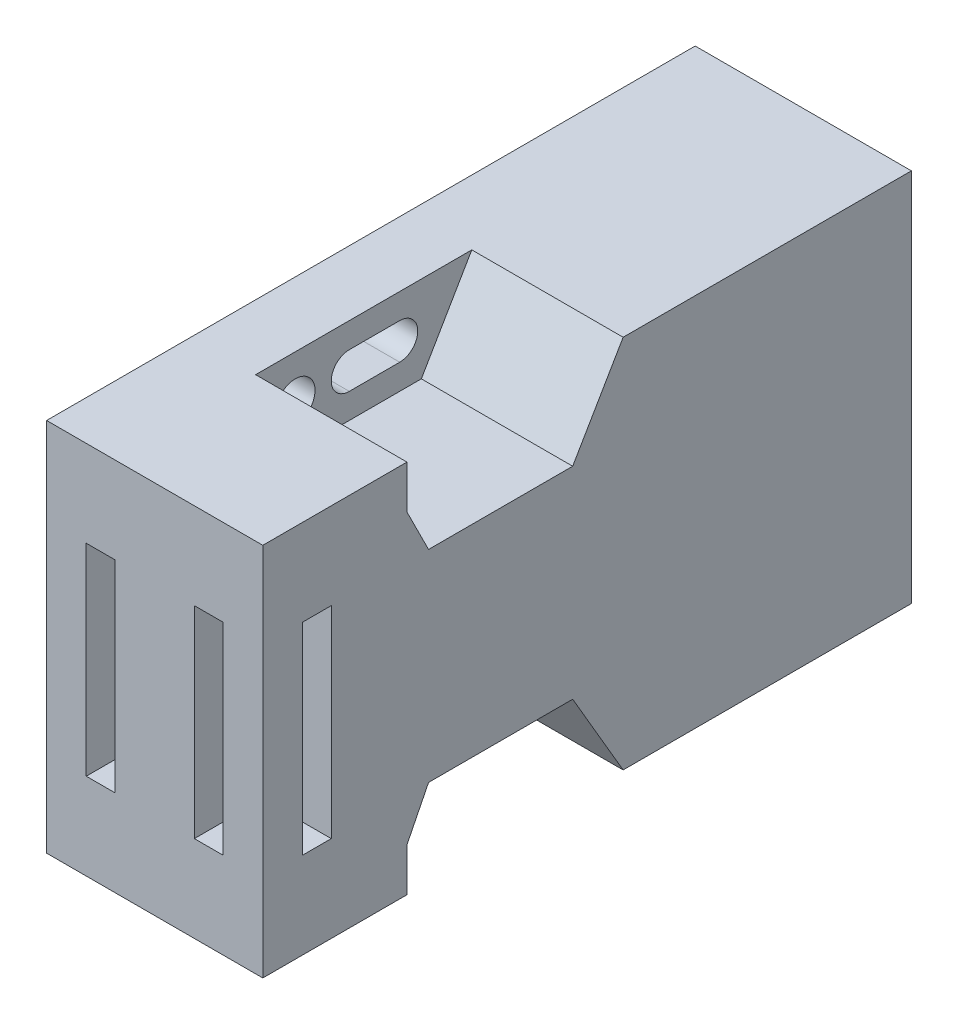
ISO-10303-21;
HEADER;
FILE_DESCRIPTION(('STEP AP214'),'2;1');
FILE_NAME('part.step','',(''),(''),'','','');
FILE_SCHEMA(('AUTOMOTIVE_DESIGN { 1 0 10303 214 1 1 1 1 }'));
ENDSEC;
DATA;
#1=APPLICATION_CONTEXT('core data for automotive mechanical design processes');
#2=APPLICATION_PROTOCOL_DEFINITION('international standard','automotive_design',2000,#1);
#3=PRODUCT_CONTEXT('',#1,'mechanical');
#4=PRODUCT('Part','Part','',(#3));
#5=PRODUCT_RELATED_PRODUCT_CATEGORY('part','',(#4));
#6=PRODUCT_DEFINITION_FORMATION('','',#4);
#7=PRODUCT_DEFINITION_CONTEXT('part definition',#1,'design');
#8=PRODUCT_DEFINITION('design','',#6,#7);
#9=PRODUCT_DEFINITION_SHAPE('','',#8);
#10=(LENGTH_UNIT() NAMED_UNIT(*) SI_UNIT(.MILLI.,.METRE.));
#11=(NAMED_UNIT(*) PLANE_ANGLE_UNIT() SI_UNIT($,.RADIAN.));
#12=(NAMED_UNIT(*) SI_UNIT($,.STERADIAN.) SOLID_ANGLE_UNIT());
#13=UNCERTAINTY_MEASURE_WITH_UNIT(LENGTH_MEASURE(1.E-05),#10,'distance_accuracy_value','');
#14=(GEOMETRIC_REPRESENTATION_CONTEXT(3) GLOBAL_UNCERTAINTY_ASSIGNED_CONTEXT((#13)) GLOBAL_UNIT_ASSIGNED_CONTEXT((#10,
#11,#12)) REPRESENTATION_CONTEXT('',''));
#15=CARTESIAN_POINT('',(0.,0.,0.));
#16=DIRECTION('',(0.,0.,1.));
#17=DIRECTION('',(1.,0.,0.));
#18=AXIS2_PLACEMENT_3D('',#15,#16,#17);
#19=CARTESIAN_POINT('',(0.,0.,-25.));
#20=DIRECTION('',(0.,0.,1.));
#21=DIRECTION('',(1.,0.,0.));
#22=AXIS2_PLACEMENT_3D('',#19,#20,#21);
#23=PLANE('',#22);
#24=DIRECTION('',(1.,0.,0.));
#25=VECTOR('',#24,1.);
#26=CARTESIAN_POINT('',(7.50000000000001,13.9999999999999,-25.));
#27=LINE('',#26,#25);
#28=CARTESIAN_POINT('',(2.,13.9999999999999,-25.));
#29=VERTEX_POINT('',#28);
#30=CARTESIAN_POINT('',(-2.,13.9999999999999,-25.));
#31=VERTEX_POINT('',#30);
#32=EDGE_CURVE('E503',#29,#31,#27,.F.);
#33=ORIENTED_EDGE('',*,*,#32,.T.);
#34=DIRECTION('',(0.,1.,0.));
#35=VECTOR('',#34,1.);
#36=CARTESIAN_POINT('',(-2.,-14.,-25.));
#37=LINE('',#36,#35);
#38=CARTESIAN_POINT('',(-2.,-14.,-25.));
#39=VERTEX_POINT('',#38);
#40=EDGE_CURVE('E438',#31,#39,#37,.F.);
#41=ORIENTED_EDGE('',*,*,#40,.T.);
#42=DIRECTION('',(1.,0.,0.));
#43=VECTOR('',#42,1.);
#44=CARTESIAN_POINT('',(7.50000000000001,-14.0000000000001,-25.));
#45=LINE('',#44,#43);
#46=CARTESIAN_POINT('',(2.,-14.0000000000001,-25.));
#47=VERTEX_POINT('',#46);
#48=EDGE_CURVE('E505',#39,#47,#45,.T.);
#49=ORIENTED_EDGE('',*,*,#48,.T.);
#50=DIRECTION('',(0.,1.,0.));
#51=VECTOR('',#50,1.);
#52=CARTESIAN_POINT('',(2.,13.9999999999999,-25.));
#53=LINE('',#52,#51);
#54=EDGE_CURVE('E420',#47,#29,#53,.T.);
#55=ORIENTED_EDGE('',*,*,#54,.T.);
#56=EDGE_LOOP('',(#33,#41,#49,#55));
#57=FACE_BOUND('',#56,.T.);
#58=ADVANCED_FACE('F15',(#57),#23,.T.);
#59=CARTESIAN_POINT('',(7.50000000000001,-14.0000000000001,-43.));
#60=DIRECTION('',(0.,1.,0.));
#61=DIRECTION('',(0.,0.,1.));
#62=AXIS2_PLACEMENT_3D('',#59,#60,#61);
#63=PLANE('',#62);
#64=DIRECTION('',(0.,0.,1.));
#65=VECTOR('',#64,1.);
#66=CARTESIAN_POINT('',(-13.5,-14.,-50.));
#67=LINE('',#66,#65);
#68=CARTESIAN_POINT('',(-13.5,-14.0000000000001,-25.));
#69=VERTEX_POINT('',#68);
#70=CARTESIAN_POINT('',(-13.5,-14.0000000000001,-43.));
#71=VERTEX_POINT('',#70);
#72=EDGE_CURVE('E455',#69,#71,#67,.F.);
#73=ORIENTED_EDGE('',*,*,#72,.T.);
#74=DIRECTION('',(1.,0.,0.));
#75=VECTOR('',#74,1.);
#76=CARTESIAN_POINT('',(7.5,-14.0000000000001,-43.));
#77=LINE('',#76,#75);
#78=CARTESIAN_POINT('',(7.50000000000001,-14.0000000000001,-43.));
#79=VERTEX_POINT('',#78);
#80=EDGE_CURVE('E501',#71,#79,#77,.T.);
#81=ORIENTED_EDGE('',*,*,#80,.T.);
#82=DIRECTION('',(0.,0.,1.));
#83=VECTOR('',#82,1.);
#84=CARTESIAN_POINT('',(7.50000000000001,-14.0000000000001,-45.));
#85=LINE('',#84,#83);
#86=CARTESIAN_POINT('',(7.50000000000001,-14.0000000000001,-23.));
#87=VERTEX_POINT('',#86);
#88=EDGE_CURVE('E414',#79,#87,#85,.T.);
#89=ORIENTED_EDGE('',*,*,#88,.T.);
#90=DIRECTION('',(1.,0.,0.));
#91=VECTOR('',#90,1.);
#92=CARTESIAN_POINT('',(7.50000000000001,-14.0000000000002,-23.));
#93=LINE('',#92,#91);
#94=CARTESIAN_POINT('',(2.,-14.0000000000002,-23.));
#95=VERTEX_POINT('',#94);
#96=EDGE_CURVE('E430',#87,#95,#93,.F.);
#97=ORIENTED_EDGE('',*,*,#96,.T.);
#98=DIRECTION('',(0.,0.,-1.));
#99=VECTOR('',#98,1.);
#100=CARTESIAN_POINT('',(2.,-14.0000000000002,-25.));
#101=LINE('',#100,#99);
#102=EDGE_CURVE('E422',#95,#47,#101,.T.);
#103=ORIENTED_EDGE('',*,*,#102,.T.);
#104=ORIENTED_EDGE('',*,*,#48,.F.);
#105=DIRECTION('',(0.,0.,1.));
#106=VECTOR('',#105,1.);
#107=CARTESIAN_POINT('',(-2.,-14.,-25.));
#108=LINE('',#107,#106);
#109=CARTESIAN_POINT('',(-2.,-14.0000000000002,-23.));
#110=VERTEX_POINT('',#109);
#111=EDGE_CURVE('E436',#39,#110,#108,.T.);
#112=ORIENTED_EDGE('',*,*,#111,.T.);
#113=DIRECTION('',(1.,0.,0.));
#114=VECTOR('',#113,1.);
#115=CARTESIAN_POINT('',(7.50000000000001,-14.0000000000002,-23.));
#116=LINE('',#115,#114);
#117=CARTESIAN_POINT('',(-13.,-14.0000000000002,-23.));
#118=VERTEX_POINT('',#117);
#119=EDGE_CURVE('E428',#110,#118,#116,.F.);
#120=ORIENTED_EDGE('',*,*,#119,.T.);
#121=DIRECTION('',(0.,0.,-1.));
#122=VECTOR('',#121,1.);
#123=CARTESIAN_POINT('',(-13.,-14.0000000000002,-25.));
#124=LINE('',#123,#122);
#125=CARTESIAN_POINT('',(-13.,-14.0000000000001,-25.));
#126=VERTEX_POINT('',#125);
#127=EDGE_CURVE('E451',#118,#126,#124,.T.);
#128=ORIENTED_EDGE('',*,*,#127,.T.);
#129=DIRECTION('',(-1.,0.,0.));
#130=VECTOR('',#129,1.);
#131=CARTESIAN_POINT('',(-15.,-14.,-25.));
#132=LINE('',#131,#130);
#133=EDGE_CURVE('E459',#126,#69,#132,.T.);
#134=ORIENTED_EDGE('',*,*,#133,.T.);
#135=EDGE_LOOP('',(#73,#81,#89,#97,#103,#104,#112,#120,#128,#134));
#136=FACE_BOUND('',#135,.T.);
#137=ADVANCED_FACE('F775',(#136),#63,.F.);
#138=CARTESIAN_POINT('',(7.50000000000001,13.9999999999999,-23.));
#139=DIRECTION('',(0.,-1.,0.));
#140=DIRECTION('',(0.,0.,-1.));
#141=AXIS2_PLACEMENT_3D('',#138,#139,#140);
#142=PLANE('',#141);
#143=DIRECTION('',(0.,0.,-1.));
#144=VECTOR('',#143,1.);
#145=CARTESIAN_POINT('',(-13.,13.9999999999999,-25.));
#146=LINE('',#145,#144);
#147=CARTESIAN_POINT('',(-13.,13.9999999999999,-25.));
#148=VERTEX_POINT('',#147);
#149=CARTESIAN_POINT('',(-13.,13.9999999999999,-23.));
#150=VERTEX_POINT('',#149);
#151=EDGE_CURVE('E445',#148,#150,#146,.F.);
#152=ORIENTED_EDGE('',*,*,#151,.T.);
#153=DIRECTION('',(1.,0.,0.));
#154=VECTOR('',#153,1.);
#155=CARTESIAN_POINT('',(7.50000000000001,13.9999999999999,-23.));
#156=LINE('',#155,#154);
#157=CARTESIAN_POINT('',(-2.,13.9999999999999,-23.));
#158=VERTEX_POINT('',#157);
#159=EDGE_CURVE('E482',#150,#158,#156,.T.);
#160=ORIENTED_EDGE('',*,*,#159,.T.);
#161=DIRECTION('',(0.,0.,1.));
#162=VECTOR('',#161,1.);
#163=CARTESIAN_POINT('',(-2.,13.9999999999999,-25.));
#164=LINE('',#163,#162);
#165=EDGE_CURVE('E440',#158,#31,#164,.F.);
#166=ORIENTED_EDGE('',*,*,#165,.T.);
#167=ORIENTED_EDGE('',*,*,#32,.F.);
#168=DIRECTION('',(0.,0.,-1.));
#169=VECTOR('',#168,1.);
#170=CARTESIAN_POINT('',(2.,13.9999999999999,-25.));
#171=LINE('',#170,#169);
#172=CARTESIAN_POINT('',(2.,13.9999999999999,-23.));
#173=VERTEX_POINT('',#172);
#174=EDGE_CURVE('E418',#29,#173,#171,.F.);
#175=ORIENTED_EDGE('',*,*,#174,.T.);
#176=DIRECTION('',(1.,0.,0.));
#177=VECTOR('',#176,1.);
#178=CARTESIAN_POINT('',(7.50000000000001,13.9999999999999,-23.));
#179=LINE('',#178,#177);
#180=CARTESIAN_POINT('',(7.50000000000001,13.9999999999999,-23.));
#181=VERTEX_POINT('',#180);
#182=EDGE_CURVE('E480',#173,#181,#179,.T.);
#183=ORIENTED_EDGE('',*,*,#182,.T.);
#184=DIRECTION('',(0.,0.,1.));
#185=VECTOR('',#184,1.);
#186=CARTESIAN_POINT('',(7.50000000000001,13.9999999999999,-45.));
#187=LINE('',#186,#185);
#188=CARTESIAN_POINT('',(7.50000000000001,13.9999999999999,-43.));
#189=VERTEX_POINT('',#188);
#190=EDGE_CURVE('E402',#181,#189,#187,.F.);
#191=ORIENTED_EDGE('',*,*,#190,.T.);
#192=DIRECTION('',(1.,0.,0.));
#193=VECTOR('',#192,1.);
#194=CARTESIAN_POINT('',(7.50000000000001,13.9999999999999,-43.));
#195=LINE('',#194,#193);
#196=CARTESIAN_POINT('',(-13.5,13.9999999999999,-43.));
#197=VERTEX_POINT('',#196);
#198=EDGE_CURVE('E486',#189,#197,#195,.F.);
#199=ORIENTED_EDGE('',*,*,#198,.T.);
#200=DIRECTION('',(0.,0.,-1.));
#201=VECTOR('',#200,1.);
#202=CARTESIAN_POINT('',(-13.5,13.9999999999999,-20.));
#203=LINE('',#202,#201);
#204=CARTESIAN_POINT('',(-13.5,13.9999999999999,-25.));
#205=VERTEX_POINT('',#204);
#206=EDGE_CURVE('E469',#205,#197,#203,.T.);
#207=ORIENTED_EDGE('',*,*,#206,.F.);
#208=DIRECTION('',(-1.,0.,0.));
#209=VECTOR('',#208,1.);
#210=CARTESIAN_POINT('',(-15.,13.9999999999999,-25.));
#211=LINE('',#210,#209);
#212=EDGE_CURVE('E461',#205,#148,#211,.F.);
#213=ORIENTED_EDGE('',*,*,#212,.T.);
#214=EDGE_LOOP('',(#152,#160,#166,#167,#175,#183,#191,#199,#207,#213));
#215=FACE_BOUND('',#214,.T.);
#216=ADVANCED_FACE('F817',(#215),#142,.F.);
#217=CARTESIAN_POINT('',(7.5,-26.0000000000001,-50.));
#218=DIRECTION('',(0.,0.503871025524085,-0.863778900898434));
#219=DIRECTION('',(0.,0.863778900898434,0.503871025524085));
#220=AXIS2_PLACEMENT_3D('',#217,#218,#219);
#221=PLANE('',#220);
#222=DIRECTION('',(1.,0.,0.));
#223=VECTOR('',#222,1.);
#224=CARTESIAN_POINT('',(7.5,-26.0000000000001,-50.));
#225=LINE('',#224,#223);
#226=CARTESIAN_POINT('',(7.5,-26.0000000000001,-50.));
#227=VERTEX_POINT('',#226);
#228=CARTESIAN_POINT('',(-13.5,-26.0000000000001,-50.));
#229=VERTEX_POINT('',#228);
#230=EDGE_CURVE('E384',#227,#229,#225,.F.);
#231=ORIENTED_EDGE('',*,*,#230,.F.);
#232=DIRECTION('',(0.,0.863778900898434,0.503871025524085));
#233=VECTOR('',#232,1.);
#234=CARTESIAN_POINT('',(7.50000000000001,-26.0000000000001,-50.));
#235=LINE('',#234,#233);
#236=EDGE_CURVE('E397',#227,#79,#235,.T.);
#237=ORIENTED_EDGE('',*,*,#236,.T.);
#238=ORIENTED_EDGE('',*,*,#80,.F.);
#239=DIRECTION('',(0.,-0.863778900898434,-0.503871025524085));
#240=VECTOR('',#239,1.);
#241=CARTESIAN_POINT('',(-13.5,-14.0000000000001,-43.));
#242=LINE('',#241,#240);
#243=EDGE_CURVE('E453',#71,#229,#242,.T.);
#244=ORIENTED_EDGE('',*,*,#243,.T.);
#245=EDGE_LOOP('',(#231,#237,#238,#244));
#246=FACE_BOUND('',#245,.T.);
#247=ADVANCED_FACE('F805',(#246),#221,.F.);
#248=CARTESIAN_POINT('',(7.50000000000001,-20.,-20.));
#249=DIRECTION('',(0.,0.,1.));
#250=DIRECTION('',(1.,0.,0.));
#251=AXIS2_PLACEMENT_3D('',#248,#249,#250);
#252=PLANE('',#251);
#253=DIRECTION('',(1.,0.,0.));
#254=VECTOR('',#253,1.);
#255=CARTESIAN_POINT('',(7.50000000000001,-20.,-20.));
#256=LINE('',#255,#254);
#257=CARTESIAN_POINT('',(-13.5,-20.,-20.));
#258=VERTEX_POINT('',#257);
#259=CARTESIAN_POINT('',(7.5,-20.,-20.));
#260=VERTEX_POINT('',#259);
#261=EDGE_CURVE('E432',#258,#260,#256,.T.);
#262=ORIENTED_EDGE('',*,*,#261,.T.);
#263=DIRECTION('',(0.,1.,0.));
#264=VECTOR('',#263,1.);
#265=CARTESIAN_POINT('',(7.50000000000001,-1.141461E-13,-20.));
#266=LINE('',#265,#264);
#267=CARTESIAN_POINT('',(7.5,-26.0000000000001,-20.));
#268=VERTEX_POINT('',#267);
#269=EDGE_CURVE('E409',#260,#268,#266,.F.);
#270=ORIENTED_EDGE('',*,*,#269,.T.);
#271=DIRECTION('',(1.,0.,0.));
#272=VECTOR('',#271,1.);
#273=CARTESIAN_POINT('',(7.5,-26.0000000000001,-20.));
#274=LINE('',#273,#272);
#275=CARTESIAN_POINT('',(-13.5,-26.0000000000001,-20.));
#276=VERTEX_POINT('',#275);
#277=EDGE_CURVE('E378',#276,#268,#274,.T.);
#278=ORIENTED_EDGE('',*,*,#277,.F.);
#279=DIRECTION('',(0.,1.,0.));
#280=VECTOR('',#279,1.);
#281=CARTESIAN_POINT('',(-13.5,-26.0000000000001,-20.));
#282=LINE('',#281,#280);
#283=EDGE_CURVE('E457',#276,#258,#282,.T.);
#284=ORIENTED_EDGE('',*,*,#283,.T.);
#285=EDGE_LOOP('',(#262,#270,#278,#284));
#286=FACE_BOUND('',#285,.T.);
#287=ADVANCED_FACE('F849',(#286),#252,.F.);
#288=CARTESIAN_POINT('',(7.50000000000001,25.9999999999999,-20.));
#289=DIRECTION('',(0.,0.,1.));
#290=DIRECTION('',(1.,0.,0.));
#291=AXIS2_PLACEMENT_3D('',#288,#289,#290);
#292=PLANE('',#291);
#293=DIRECTION('',(1.,0.,0.));
#294=VECTOR('',#293,1.);
#295=CARTESIAN_POINT('',(7.50000000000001,25.9999999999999,-20.));
#296=LINE('',#295,#294);
#297=CARTESIAN_POINT('',(7.50000000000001,25.9999999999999,-20.));
#298=VERTEX_POINT('',#297);
#299=CARTESIAN_POINT('',(-13.5,25.9999999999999,-20.));
#300=VERTEX_POINT('',#299);
#301=EDGE_CURVE('E350',#298,#300,#296,.F.);
#302=ORIENTED_EDGE('',*,*,#301,.F.);
#303=DIRECTION('',(0.,1.,0.));
#304=VECTOR('',#303,1.);
#305=CARTESIAN_POINT('',(7.50000000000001,-1.141461E-13,-20.));
#306=LINE('',#305,#304);
#307=CARTESIAN_POINT('',(7.50000000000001,19.9999999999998,-20.));
#308=VERTEX_POINT('',#307);
#309=EDGE_CURVE('E407',#298,#308,#306,.F.);
#310=ORIENTED_EDGE('',*,*,#309,.T.);
#311=DIRECTION('',(1.,0.,0.));
#312=VECTOR('',#311,1.);
#313=CARTESIAN_POINT('',(7.50000000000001,19.9999999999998,-20.));
#314=LINE('',#313,#312);
#315=CARTESIAN_POINT('',(-13.5,19.9999999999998,-20.));
#316=VERTEX_POINT('',#315);
#317=EDGE_CURVE('E478',#308,#316,#314,.F.);
#318=ORIENTED_EDGE('',*,*,#317,.T.);
#319=DIRECTION('',(0.,1.,0.));
#320=VECTOR('',#319,1.);
#321=CARTESIAN_POINT('',(-13.5,25.9999999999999,-20.));
#322=LINE('',#321,#320);
#323=EDGE_CURVE('E475',#300,#316,#322,.F.);
#324=ORIENTED_EDGE('',*,*,#323,.F.);
#325=EDGE_LOOP('',(#302,#310,#318,#324));
#326=FACE_BOUND('',#325,.T.);
#327=ADVANCED_FACE('F1105',(#326),#292,.F.);
#328=CARTESIAN_POINT('',(7.50000000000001,13.9999999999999,-43.));
#329=DIRECTION('',(0.,-0.503871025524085,-0.863778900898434));
#330=DIRECTION('',(0.,0.863778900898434,-0.503871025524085));
#331=AXIS2_PLACEMENT_3D('',#328,#329,#330);
#332=PLANE('',#331);
#333=ORIENTED_EDGE('',*,*,#198,.F.);
#334=DIRECTION('',(0.,0.863778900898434,-0.503871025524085));
#335=VECTOR('',#334,1.);
#336=CARTESIAN_POINT('',(7.50000000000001,13.9999999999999,-43.));
#337=LINE('',#336,#335);
#338=CARTESIAN_POINT('',(7.50000000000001,25.9999999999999,-50.));
#339=VERTEX_POINT('',#338);
#340=EDGE_CURVE('E400',#189,#339,#337,.T.);
#341=ORIENTED_EDGE('',*,*,#340,.T.);
#342=DIRECTION('',(1.,0.,0.));
#343=VECTOR('',#342,1.);
#344=CARTESIAN_POINT('',(7.50000000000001,25.9999999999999,-50.));
#345=LINE('',#344,#343);
#346=CARTESIAN_POINT('',(-13.5,25.9999999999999,-50.));
#347=VERTEX_POINT('',#346);
#348=EDGE_CURVE('E344',#347,#339,#345,.T.);
#349=ORIENTED_EDGE('',*,*,#348,.F.);
#350=DIRECTION('',(0.,0.863778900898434,-0.503871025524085));
#351=VECTOR('',#350,1.);
#352=CARTESIAN_POINT('',(-13.5,13.9999999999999,-43.));
#353=LINE('',#352,#351);
#354=EDGE_CURVE('E467',#197,#347,#353,.T.);
#355=ORIENTED_EDGE('',*,*,#354,.F.);
#356=EDGE_LOOP('',(#333,#341,#349,#355));
#357=FACE_BOUND('',#356,.T.);
#358=ADVANCED_FACE('F833',(#357),#332,.F.);
#359=CARTESIAN_POINT('',(7.50000000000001,19.9999999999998,-20.));
#360=DIRECTION('',(0.,-0.447213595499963,0.894427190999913));
#361=DIRECTION('',(0.,-0.894427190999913,-0.447213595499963));
#362=AXIS2_PLACEMENT_3D('',#359,#360,#361);
#363=PLANE('',#362);
#364=ORIENTED_EDGE('',*,*,#317,.F.);
#365=DIRECTION('',(0.,-0.894427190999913,-0.447213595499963));
#366=VECTOR('',#365,1.);
#367=CARTESIAN_POINT('',(7.50000000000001,19.9999999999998,-20.));
#368=LINE('',#367,#366);
#369=EDGE_CURVE('E404',#308,#181,#368,.T.);
#370=ORIENTED_EDGE('',*,*,#369,.T.);
#371=ORIENTED_EDGE('',*,*,#182,.F.);
#372=DIRECTION('',(1.,0.,0.));
#373=VECTOR('',#372,1.);
#374=CARTESIAN_POINT('',(7.50000000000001,13.9999999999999,-23.));
#375=LINE('',#374,#373);
#376=EDGE_CURVE('E667',#173,#158,#375,.F.);
#377=ORIENTED_EDGE('',*,*,#376,.T.);
#378=ORIENTED_EDGE('',*,*,#159,.F.);
#379=DIRECTION('',(1.,0.,0.));
#380=VECTOR('',#379,1.);
#381=CARTESIAN_POINT('',(7.50000000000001,13.9999999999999,-23.));
#382=LINE('',#381,#380);
#383=CARTESIAN_POINT('',(-13.5,13.9999999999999,-23.));
#384=VERTEX_POINT('',#383);
#385=EDGE_CURVE('E484',#384,#150,#382,.T.);
#386=ORIENTED_EDGE('',*,*,#385,.F.);
#387=DIRECTION('',(0.,-0.894427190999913,-0.447213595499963));
#388=VECTOR('',#387,1.);
#389=CARTESIAN_POINT('',(-13.5,19.9999999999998,-20.));
#390=LINE('',#389,#388);
#391=EDGE_CURVE('E472',#316,#384,#390,.T.);
#392=ORIENTED_EDGE('',*,*,#391,.F.);
#393=EDGE_LOOP('',(#364,#370,#371,#377,#378,#386,#392));
#394=FACE_BOUND('',#393,.T.);
#395=ADVANCED_FACE('F825',(#394),#363,.F.);
#396=CARTESIAN_POINT('',(-13.5,25.9999999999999,-20.));
#397=DIRECTION('',(1.,0.,0.));
#398=DIRECTION('',(0.,0.,-1.));
#399=AXIS2_PLACEMENT_3D('',#396,#397,#398);
#400=PLANE('',#399);
#401=CARTESIAN_POINT('',(-13.5,19.9999999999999,-33.));
#402=DIRECTION('',(-1.,0.,0.));
#403=DIRECTION('',(0.,-1.,0.));
#404=AXIS2_PLACEMENT_3D('',#401,#402,#403);
#405=CIRCLE('',#404,2.5);
#406=CARTESIAN_POINT('',(-13.5,17.4999999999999,-33.));
#407=VERTEX_POINT('',#406);
#408=CARTESIAN_POINT('',(-13.5,22.4999999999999,-33.));
#409=VERTEX_POINT('',#408);
#410=EDGE_CURVE('E528',#407,#409,#405,.T.);
#411=ORIENTED_EDGE('',*,*,#410,.T.);
#412=DIRECTION('',(0.,0.,1.));
#413=VECTOR('',#412,1.);
#414=CARTESIAN_POINT('',(-13.5,22.4999999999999,-40.));
#415=LINE('',#414,#413);
#416=CARTESIAN_POINT('',(-13.5,22.4999999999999,-40.));
#417=VERTEX_POINT('',#416);
#418=EDGE_CURVE('E492',#409,#417,#415,.F.);
#419=ORIENTED_EDGE('',*,*,#418,.T.);
#420=CARTESIAN_POINT('',(-13.5,19.9999999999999,-40.));
#421=DIRECTION('',(-1.,0.,0.));
#422=DIRECTION('',(0.,-1.,0.));
#423=AXIS2_PLACEMENT_3D('',#420,#421,#422);
#424=CIRCLE('',#423,2.5);
#425=CARTESIAN_POINT('',(-13.5,17.4999999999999,-40.));
#426=VERTEX_POINT('',#425);
#427=EDGE_CURVE('E532',#417,#426,#424,.T.);
#428=ORIENTED_EDGE('',*,*,#427,.T.);
#429=DIRECTION('',(0.,0.,-1.));
#430=VECTOR('',#429,1.);
#431=CARTESIAN_POINT('',(-13.5,17.4999999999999,-33.));
#432=LINE('',#431,#430);
#433=EDGE_CURVE('E487',#426,#407,#432,.F.);
#434=ORIENTED_EDGE('',*,*,#433,.T.);
#435=EDGE_LOOP('',(#411,#419,#428,#434));
#436=FACE_BOUND('',#435,.T.);
#437=CARTESIAN_POINT('',(-13.5,19.9999999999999,-25.5));
#438=DIRECTION('',(-1.,0.,0.));
#439=DIRECTION('',(0.,-1.,0.));
#440=AXIS2_PLACEMENT_3D('',#437,#438,#439);
#441=CIRCLE('',#440,2.75);
#442=CARTESIAN_POINT('',(-13.5,17.2499999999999,-25.5));
#443=VERTEX_POINT('',#442);
#444=EDGE_CURVE('E534',#443,#443,#441,.T.);
#445=ORIENTED_EDGE('',*,*,#444,.T.);
#446=EDGE_LOOP('',(#445));
#447=FACE_BOUND('',#446,.T.);
#448=ORIENTED_EDGE('',*,*,#354,.T.);
#449=DIRECTION('',(0.,0.,1.));
#450=VECTOR('',#449,1.);
#451=CARTESIAN_POINT('',(-13.5,25.9999999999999,-90.));
#452=LINE('',#451,#450);
#453=EDGE_CURVE('E347',#300,#347,#452,.F.);
#454=ORIENTED_EDGE('',*,*,#453,.F.);
#455=ORIENTED_EDGE('',*,*,#323,.T.);
#456=ORIENTED_EDGE('',*,*,#391,.T.);
#457=DIRECTION('',(0.,0.,1.));
#458=VECTOR('',#457,1.);
#459=CARTESIAN_POINT('',(-13.5,13.9999999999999,-9.5));
#460=LINE('',#459,#458);
#461=EDGE_CURVE('E655',#384,#205,#460,.F.);
#462=ORIENTED_EDGE('',*,*,#461,.T.);
#463=ORIENTED_EDGE('',*,*,#206,.T.);
#464=EDGE_LOOP('',(#448,#454,#455,#456,#462,#463));
#465=FACE_BOUND('',#464,.T.);
#466=ADVANCED_FACE('F841',(#436,#447,#465),#400,.T.);
#467=CARTESIAN_POINT('',(2.,13.9999999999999,-25.));
#468=DIRECTION('',(1.,0.,0.));
#469=DIRECTION('',(0.,0.,-1.));
#470=AXIS2_PLACEMENT_3D('',#467,#468,#469);
#471=PLANE('',#470);
#472=DIRECTION('',(0.,0.,-1.));
#473=VECTOR('',#472,1.);
#474=CARTESIAN_POINT('',(2.,-14.0000000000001,-5.5));
#475=LINE('',#474,#473);
#476=CARTESIAN_POINT('',(2.,-14.,-5.5));
#477=VERTEX_POINT('',#476);
#478=CARTESIAN_POINT('',(2.,-14.,0.));
#479=VERTEX_POINT('',#478);
#480=EDGE_CURVE('E617',#477,#479,#475,.F.);
#481=ORIENTED_EDGE('',*,*,#480,.T.);
#482=DIRECTION('',(0.,1.,0.));
#483=VECTOR('',#482,1.);
#484=CARTESIAN_POINT('',(2.,25.9999999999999,0.));
#485=LINE('',#484,#483);
#486=CARTESIAN_POINT('',(2.,13.9999999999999,0.));
#487=VERTEX_POINT('',#486);
#488=EDGE_CURVE('E353',#487,#479,#485,.F.);
#489=ORIENTED_EDGE('',*,*,#488,.F.);
#490=DIRECTION('',(0.,0.,1.));
#491=VECTOR('',#490,1.);
#492=CARTESIAN_POINT('',(2.,13.9999999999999,-9.5));
#493=LINE('',#492,#491);
#494=CARTESIAN_POINT('',(2.,13.9999999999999,-5.5));
#495=VERTEX_POINT('',#494);
#496=EDGE_CURVE('E633',#487,#495,#493,.F.);
#497=ORIENTED_EDGE('',*,*,#496,.T.);
#498=DIRECTION('',(0.,1.,0.));
#499=VECTOR('',#498,1.);
#500=CARTESIAN_POINT('',(2.,13.9999999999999,-5.5));
#501=LINE('',#500,#499);
#502=EDGE_CURVE('E391',#495,#477,#501,.F.);
#503=ORIENTED_EDGE('',*,*,#502,.T.);
#504=EDGE_LOOP('',(#481,#489,#497,#503));
#505=FACE_BOUND('',#504,.T.);
#506=ADVANCED_FACE('F739',(#505),#471,.F.);
#507=CARTESIAN_POINT('',(-2.,-14.,-25.));
#508=DIRECTION('',(-1.,0.,0.));
#509=DIRECTION('',(0.,0.,1.));
#510=AXIS2_PLACEMENT_3D('',#507,#508,#509);
#511=PLANE('',#510);
#512=DIRECTION('',(0.,0.,1.));
#513=VECTOR('',#512,1.);
#514=CARTESIAN_POINT('',(-2.,13.9999999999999,-9.5));
#515=LINE('',#514,#513);
#516=CARTESIAN_POINT('',(-2.,13.9999999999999,-5.5));
#517=VERTEX_POINT('',#516);
#518=CARTESIAN_POINT('',(-2.,13.9999999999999,0.));
#519=VERTEX_POINT('',#518);
#520=EDGE_CURVE('E638',#517,#519,#515,.T.);
#521=ORIENTED_EDGE('',*,*,#520,.T.);
#522=DIRECTION('',(0.,1.,0.));
#523=VECTOR('',#522,1.);
#524=CARTESIAN_POINT('',(-2.,25.9999999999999,0.));
#525=LINE('',#524,#523);
#526=CARTESIAN_POINT('',(-2.,-14.,0.));
#527=VERTEX_POINT('',#526);
#528=EDGE_CURVE('E356',#527,#519,#525,.T.);
#529=ORIENTED_EDGE('',*,*,#528,.F.);
#530=DIRECTION('',(0.,0.,-1.));
#531=VECTOR('',#530,1.);
#532=CARTESIAN_POINT('',(-2.,-14.0000000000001,-5.5));
#533=LINE('',#532,#531);
#534=CARTESIAN_POINT('',(-2.,-14.,-5.5));
#535=VERTEX_POINT('',#534);
#536=EDGE_CURVE('E612',#527,#535,#533,.T.);
#537=ORIENTED_EDGE('',*,*,#536,.T.);
#538=DIRECTION('',(0.,1.,0.));
#539=VECTOR('',#538,1.);
#540=CARTESIAN_POINT('',(-2.,13.9999999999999,-5.5));
#541=LINE('',#540,#539);
#542=EDGE_CURVE('E465',#535,#517,#541,.T.);
#543=ORIENTED_EDGE('',*,*,#542,.T.);
#544=EDGE_LOOP('',(#521,#529,#537,#543));
#545=FACE_BOUND('',#544,.T.);
#546=ADVANCED_FACE('F731',(#545),#511,.F.);
#547=CARTESIAN_POINT('',(7.50000000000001,13.9999999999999,-5.5));
#548=DIRECTION('',(0.,0.,1.));
#549=DIRECTION('',(1.,0.,0.));
#550=AXIS2_PLACEMENT_3D('',#547,#548,#549);
#551=PLANE('',#550);
#552=DIRECTION('',(1.,0.,0.));
#553=VECTOR('',#552,1.);
#554=CARTESIAN_POINT('',(7.50000000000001,13.9999999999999,-5.5));
#555=LINE('',#554,#553);
#556=CARTESIAN_POINT('',(-13.,13.9999999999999,-5.5));
#557=VERTEX_POINT('',#556);
#558=EDGE_CURVE('E640',#557,#517,#555,.T.);
#559=ORIENTED_EDGE('',*,*,#558,.T.);
#560=ORIENTED_EDGE('',*,*,#542,.F.);
#561=DIRECTION('',(1.,0.,0.));
#562=VECTOR('',#561,1.);
#563=CARTESIAN_POINT('',(7.50000000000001,-14.0000000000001,-5.5));
#564=LINE('',#563,#562);
#565=CARTESIAN_POINT('',(-13.,-14.,-5.5));
#566=VERTEX_POINT('',#565);
#567=EDGE_CURVE('E610',#535,#566,#564,.F.);
#568=ORIENTED_EDGE('',*,*,#567,.T.);
#569=DIRECTION('',(0.,1.,0.));
#570=VECTOR('',#569,1.);
#571=CARTESIAN_POINT('',(-13.,13.9999999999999,-5.5));
#572=LINE('',#571,#570);
#573=EDGE_CURVE('E463',#566,#557,#572,.T.);
#574=ORIENTED_EDGE('',*,*,#573,.T.);
#575=EDGE_LOOP('',(#559,#560,#568,#574));
#576=FACE_BOUND('',#575,.T.);
#577=ADVANCED_FACE('F727',(#576),#551,.F.);
#578=CARTESIAN_POINT('',(-13.,13.9999999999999,-25.));
#579=DIRECTION('',(1.,0.,0.));
#580=DIRECTION('',(0.,0.,-1.));
#581=AXIS2_PLACEMENT_3D('',#578,#579,#580);
#582=PLANE('',#581);
#583=DIRECTION('',(0.,0.,-1.));
#584=VECTOR('',#583,1.);
#585=CARTESIAN_POINT('',(-13.,-14.0000000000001,-5.5));
#586=LINE('',#585,#584);
#587=CARTESIAN_POINT('',(-13.,-14.,0.));
#588=VERTEX_POINT('',#587);
#589=EDGE_CURVE('E608',#566,#588,#586,.F.);
#590=ORIENTED_EDGE('',*,*,#589,.T.);
#591=DIRECTION('',(0.,1.,0.));
#592=VECTOR('',#591,1.);
#593=CARTESIAN_POINT('',(-13.,25.9999999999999,0.));
#594=LINE('',#593,#592);
#595=CARTESIAN_POINT('',(-13.,13.9999999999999,0.));
#596=VERTEX_POINT('',#595);
#597=EDGE_CURVE('E359',#596,#588,#594,.F.);
#598=ORIENTED_EDGE('',*,*,#597,.F.);
#599=DIRECTION('',(0.,0.,1.));
#600=VECTOR('',#599,1.);
#601=CARTESIAN_POINT('',(-13.,13.9999999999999,-9.5));
#602=LINE('',#601,#600);
#603=EDGE_CURVE('E643',#596,#557,#602,.F.);
#604=ORIENTED_EDGE('',*,*,#603,.T.);
#605=ORIENTED_EDGE('',*,*,#573,.F.);
#606=EDGE_LOOP('',(#590,#598,#604,#605));
#607=FACE_BOUND('',#606,.T.);
#608=ADVANCED_FACE('F723',(#607),#582,.F.);
#609=CARTESIAN_POINT('',(-17.,-14.,-25.));
#610=DIRECTION('',(-1.,0.,0.));
#611=DIRECTION('',(0.,0.,1.));
#612=AXIS2_PLACEMENT_3D('',#609,#610,#611);
#613=PLANE('',#612);
#614=DIRECTION('',(0.,0.,1.));
#615=VECTOR('',#614,1.);
#616=CARTESIAN_POINT('',(-17.,13.9999999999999,-9.5));
#617=LINE('',#616,#615);
#618=CARTESIAN_POINT('',(-17.,13.9999999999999,-5.5));
#619=VERTEX_POINT('',#618);
#620=CARTESIAN_POINT('',(-17.,13.9999999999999,0.));
#621=VERTEX_POINT('',#620);
#622=EDGE_CURVE('E649',#619,#621,#617,.T.);
#623=ORIENTED_EDGE('',*,*,#622,.T.);
#624=DIRECTION('',(0.,1.,0.));
#625=VECTOR('',#624,1.);
#626=CARTESIAN_POINT('',(-17.,25.9999999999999,0.));
#627=LINE('',#626,#625);
#628=CARTESIAN_POINT('',(-17.,-14.,0.));
#629=VERTEX_POINT('',#628);
#630=EDGE_CURVE('E362',#629,#621,#627,.T.);
#631=ORIENTED_EDGE('',*,*,#630,.F.);
#632=DIRECTION('',(0.,0.,-1.));
#633=VECTOR('',#632,1.);
#634=CARTESIAN_POINT('',(-17.,-14.0000000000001,-5.5));
#635=LINE('',#634,#633);
#636=CARTESIAN_POINT('',(-17.,-14.0000000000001,-5.5));
#637=VERTEX_POINT('',#636);
#638=EDGE_CURVE('E603',#629,#637,#635,.T.);
#639=ORIENTED_EDGE('',*,*,#638,.T.);
#640=DIRECTION('',(0.,1.,0.));
#641=VECTOR('',#640,1.);
#642=CARTESIAN_POINT('',(-17.,13.9999999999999,-5.5));
#643=LINE('',#642,#641);
#644=EDGE_CURVE('E619',#637,#619,#643,.T.);
#645=ORIENTED_EDGE('',*,*,#644,.T.);
#646=EDGE_LOOP('',(#623,#631,#639,#645));
#647=FACE_BOUND('',#646,.T.);
#648=ADVANCED_FACE('F713',(#647),#613,.F.);
#649=CARTESIAN_POINT('',(-15.,0.,-25.));
#650=DIRECTION('',(0.,0.,-1.));
#651=DIRECTION('',(-1.,0.,0.));
#652=AXIS2_PLACEMENT_3D('',#649,#650,#651);
#653=PLANE('',#652);
#654=ORIENTED_EDGE('',*,*,#133,.F.);
#655=DIRECTION('',(0.,1.,0.));
#656=VECTOR('',#655,1.);
#657=CARTESIAN_POINT('',(-13.,13.9999999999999,-25.));
#658=LINE('',#657,#656);
#659=EDGE_CURVE('E448',#126,#148,#658,.T.);
#660=ORIENTED_EDGE('',*,*,#659,.T.);
#661=ORIENTED_EDGE('',*,*,#212,.F.);
#662=DIRECTION('',(1.,0.,0.));
#663=VECTOR('',#662,1.);
#664=CARTESIAN_POINT('',(7.50000000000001,13.9999999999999,-25.));
#665=LINE('',#664,#663);
#666=CARTESIAN_POINT('',(-17.,13.9999999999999,-25.));
#667=VERTEX_POINT('',#666);
#668=EDGE_CURVE('E653',#205,#667,#665,.F.);
#669=ORIENTED_EDGE('',*,*,#668,.T.);
#670=DIRECTION('',(0.,1.,0.));
#671=VECTOR('',#670,1.);
#672=CARTESIAN_POINT('',(-17.,-14.,-25.));
#673=LINE('',#672,#671);
#674=CARTESIAN_POINT('',(-17.,-14.,-25.));
#675=VERTEX_POINT('',#674);
#676=EDGE_CURVE('E389',#667,#675,#673,.F.);
#677=ORIENTED_EDGE('',*,*,#676,.T.);
#678=DIRECTION('',(1.,0.,0.));
#679=VECTOR('',#678,1.);
#680=CARTESIAN_POINT('',(7.50000000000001,-14.0000000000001,-25.));
#681=LINE('',#680,#679);
#682=EDGE_CURVE('E595',#675,#69,#681,.T.);
#683=ORIENTED_EDGE('',*,*,#682,.T.);
#684=EDGE_LOOP('',(#654,#660,#661,#669,#677,#683));
#685=FACE_BOUND('',#684,.T.);
#686=ADVANCED_FACE('F798',(#685),#653,.F.);
#687=CARTESIAN_POINT('',(-13.5,-26.0000000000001,-50.));
#688=DIRECTION('',(-1.,0.,0.));
#689=DIRECTION('',(0.,0.,1.));
#690=AXIS2_PLACEMENT_3D('',#687,#688,#689);
#691=PLANE('',#690);
#692=CARTESIAN_POINT('',(-13.5,-20.0000000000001,-25.5));
#693=DIRECTION('',(-1.,0.,0.));
#694=DIRECTION('',(0.,-1.,0.));
#695=AXIS2_PLACEMENT_3D('',#692,#693,#694);
#696=CIRCLE('',#695,2.75);
#697=CARTESIAN_POINT('',(-13.5,-22.7500000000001,-25.5));
#698=VERTEX_POINT('',#697);
#699=EDGE_CURVE('E498',#698,#698,#696,.T.);
#700=ORIENTED_EDGE('',*,*,#699,.T.);
#701=EDGE_LOOP('',(#700));
#702=FACE_BOUND('',#701,.T.);
#703=DIRECTION('',(0.,0.,1.));
#704=VECTOR('',#703,1.);
#705=CARTESIAN_POINT('',(-13.5,-17.5000000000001,-40.));
#706=LINE('',#705,#704);
#707=CARTESIAN_POINT('',(-13.5,-17.5000000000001,-33.));
#708=VERTEX_POINT('',#707);
#709=CARTESIAN_POINT('',(-13.5,-17.5000000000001,-40.));
#710=VERTEX_POINT('',#709);
#711=EDGE_CURVE('E497',#708,#710,#706,.F.);
#712=ORIENTED_EDGE('',*,*,#711,.T.);
#713=CARTESIAN_POINT('',(-13.5,-20.0000000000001,-40.));
#714=DIRECTION('',(-1.,0.,0.));
#715=DIRECTION('',(0.,-1.,0.));
#716=AXIS2_PLACEMENT_3D('',#713,#714,#715);
#717=CIRCLE('',#716,2.5);
#718=CARTESIAN_POINT('',(-13.5,-22.5000000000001,-40.));
#719=VERTEX_POINT('',#718);
#720=EDGE_CURVE('E320',#710,#719,#717,.T.);
#721=ORIENTED_EDGE('',*,*,#720,.T.);
#722=DIRECTION('',(0.,0.,-1.));
#723=VECTOR('',#722,1.);
#724=CARTESIAN_POINT('',(-13.5,-22.5000000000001,-33.));
#725=LINE('',#724,#723);
#726=CARTESIAN_POINT('',(-13.5,-22.5000000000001,-33.));
#727=VERTEX_POINT('',#726);
#728=EDGE_CURVE('E317',#719,#727,#725,.F.);
#729=ORIENTED_EDGE('',*,*,#728,.T.);
#730=CARTESIAN_POINT('',(-13.5,-20.0000000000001,-33.));
#731=DIRECTION('',(-1.,0.,0.));
#732=DIRECTION('',(0.,-1.,0.));
#733=AXIS2_PLACEMENT_3D('',#730,#731,#732);
#734=CIRCLE('',#733,2.5);
#735=EDGE_CURVE('E18',#727,#708,#734,.T.);
#736=ORIENTED_EDGE('',*,*,#735,.T.);
#737=EDGE_LOOP('',(#712,#721,#729,#736));
#738=FACE_BOUND('',#737,.T.);
#739=ORIENTED_EDGE('',*,*,#72,.F.);
#740=DIRECTION('',(0.,0.,-1.));
#741=VECTOR('',#740,1.);
#742=CARTESIAN_POINT('',(-13.5,-14.0000000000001,-5.5));
#743=LINE('',#742,#741);
#744=CARTESIAN_POINT('',(-13.5,-14.0000000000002,-23.));
#745=VERTEX_POINT('',#744);
#746=EDGE_CURVE('E593',#69,#745,#743,.F.);
#747=ORIENTED_EDGE('',*,*,#746,.T.);
#748=DIRECTION('',(0.,-0.894427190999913,0.447213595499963));
#749=VECTOR('',#748,1.);
#750=CARTESIAN_POINT('',(-13.5,-14.0000000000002,-23.));
#751=LINE('',#750,#749);
#752=EDGE_CURVE('E425',#745,#258,#751,.T.);
#753=ORIENTED_EDGE('',*,*,#752,.T.);
#754=ORIENTED_EDGE('',*,*,#283,.F.);
#755=DIRECTION('',(0.,0.,-1.));
#756=VECTOR('',#755,1.);
#757=CARTESIAN_POINT('',(-13.5,-26.0000000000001,0.));
#758=LINE('',#757,#756);
#759=EDGE_CURVE('E381',#229,#276,#758,.F.);
#760=ORIENTED_EDGE('',*,*,#759,.F.);
#761=ORIENTED_EDGE('',*,*,#243,.F.);
#762=EDGE_LOOP('',(#739,#747,#753,#754,#760,#761));
#763=FACE_BOUND('',#762,.T.);
#764=ADVANCED_FACE('F318',(#702,#738,#763),#691,.F.);
#765=CARTESIAN_POINT('',(-13.,13.9999999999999,-25.));
#766=DIRECTION('',(1.,0.,0.));
#767=DIRECTION('',(0.,0.,-1.));
#768=AXIS2_PLACEMENT_3D('',#765,#766,#767);
#769=PLANE('',#768);
#770=DIRECTION('',(0.,0.,1.));
#771=VECTOR('',#770,1.);
#772=CARTESIAN_POINT('',(-13.,13.9999999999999,-9.5));
#773=LINE('',#772,#771);
#774=CARTESIAN_POINT('',(-13.,13.9999999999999,-9.5));
#775=VERTEX_POINT('',#774);
#776=EDGE_CURVE('E658',#775,#150,#773,.F.);
#777=ORIENTED_EDGE('',*,*,#776,.T.);
#778=ORIENTED_EDGE('',*,*,#151,.F.);
#779=ORIENTED_EDGE('',*,*,#659,.F.);
#780=ORIENTED_EDGE('',*,*,#127,.F.);
#781=DIRECTION('',(0.,0.,-1.));
#782=VECTOR('',#781,1.);
#783=CARTESIAN_POINT('',(-13.,-14.0000000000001,-5.5));
#784=LINE('',#783,#782);
#785=CARTESIAN_POINT('',(-13.,-14.0000000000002,-9.5));
#786=VERTEX_POINT('',#785);
#787=EDGE_CURVE('E588',#118,#786,#784,.F.);
#788=ORIENTED_EDGE('',*,*,#787,.T.);
#789=DIRECTION('',(0.,1.,0.));
#790=VECTOR('',#789,1.);
#791=CARTESIAN_POINT('',(-13.,-14.0000000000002,-9.5));
#792=LINE('',#791,#790);
#793=EDGE_CURVE('E443',#786,#775,#792,.T.);
#794=ORIENTED_EDGE('',*,*,#793,.T.);
#795=EDGE_LOOP('',(#777,#778,#779,#780,#788,#794));
#796=FACE_BOUND('',#795,.T.);
#797=ADVANCED_FACE('F793',(#796),#769,.F.);
#798=CARTESIAN_POINT('',(7.50000000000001,-14.0000000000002,-9.5));
#799=DIRECTION('',(0.,0.,-1.));
#800=DIRECTION('',(-1.,0.,0.));
#801=AXIS2_PLACEMENT_3D('',#798,#799,#800);
#802=PLANE('',#801);
#803=DIRECTION('',(1.,0.,0.));
#804=VECTOR('',#803,1.);
#805=CARTESIAN_POINT('',(7.50000000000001,-14.0000000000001,-9.5));
#806=LINE('',#805,#804);
#807=CARTESIAN_POINT('',(-2.,-14.0000000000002,-9.5));
#808=VERTEX_POINT('',#807);
#809=EDGE_CURVE('E586',#786,#808,#806,.T.);
#810=ORIENTED_EDGE('',*,*,#809,.T.);
#811=DIRECTION('',(0.,1.,0.));
#812=VECTOR('',#811,1.);
#813=CARTESIAN_POINT('',(-2.,-14.,-9.5));
#814=LINE('',#813,#812);
#815=CARTESIAN_POINT('',(-2.,13.9999999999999,-9.5));
#816=VERTEX_POINT('',#815);
#817=EDGE_CURVE('E434',#808,#816,#814,.T.);
#818=ORIENTED_EDGE('',*,*,#817,.T.);
#819=DIRECTION('',(1.,0.,0.));
#820=VECTOR('',#819,1.);
#821=CARTESIAN_POINT('',(7.50000000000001,13.9999999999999,-9.5));
#822=LINE('',#821,#820);
#823=EDGE_CURVE('E661',#816,#775,#822,.F.);
#824=ORIENTED_EDGE('',*,*,#823,.T.);
#825=ORIENTED_EDGE('',*,*,#793,.F.);
#826=EDGE_LOOP('',(#810,#818,#824,#825));
#827=FACE_BOUND('',#826,.T.);
#828=ADVANCED_FACE('F787',(#827),#802,.F.);
#829=CARTESIAN_POINT('',(-2.,-14.,-25.));
#830=DIRECTION('',(-1.,0.,0.));
#831=DIRECTION('',(0.,0.,1.));
#832=AXIS2_PLACEMENT_3D('',#829,#830,#831);
#833=PLANE('',#832);
#834=DIRECTION('',(0.,0.,-1.));
#835=VECTOR('',#834,1.);
#836=CARTESIAN_POINT('',(-2.,-14.0000000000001,-5.5));
#837=LINE('',#836,#835);
#838=EDGE_CURVE('E583',#808,#110,#837,.T.);
#839=ORIENTED_EDGE('',*,*,#838,.T.);
#840=ORIENTED_EDGE('',*,*,#111,.F.);
#841=ORIENTED_EDGE('',*,*,#40,.F.);
#842=ORIENTED_EDGE('',*,*,#165,.F.);
#843=DIRECTION('',(0.,0.,1.));
#844=VECTOR('',#843,1.);
#845=CARTESIAN_POINT('',(-2.,13.9999999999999,-9.5));
#846=LINE('',#845,#844);
#847=EDGE_CURVE('E664',#158,#816,#846,.T.);
#848=ORIENTED_EDGE('',*,*,#847,.T.);
#849=ORIENTED_EDGE('',*,*,#817,.F.);
#850=EDGE_LOOP('',(#839,#840,#841,#842,#848,#849));
#851=FACE_BOUND('',#850,.T.);
#852=ADVANCED_FACE('F782',(#851),#833,.F.);
#853=CARTESIAN_POINT('',(7.50000000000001,-14.0000000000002,-23.));
#854=DIRECTION('',(0.,0.447213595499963,0.894427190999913));
#855=DIRECTION('',(0.,-0.894427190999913,0.447213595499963));
#856=AXIS2_PLACEMENT_3D('',#853,#854,#855);
#857=PLANE('',#856);
#858=DIRECTION('',(1.,0.,0.));
#859=VECTOR('',#858,1.);
#860=CARTESIAN_POINT('',(7.50000000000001,-14.0000000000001,-23.));
#861=LINE('',#860,#859);
#862=EDGE_CURVE('E590',#745,#118,#861,.T.);
#863=ORIENTED_EDGE('',*,*,#862,.T.);
#864=ORIENTED_EDGE('',*,*,#119,.F.);
#865=DIRECTION('',(1.,0.,0.));
#866=VECTOR('',#865,1.);
#867=CARTESIAN_POINT('',(7.50000000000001,-14.0000000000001,-23.));
#868=LINE('',#867,#866);
#869=EDGE_CURVE('E580',#110,#95,#868,.T.);
#870=ORIENTED_EDGE('',*,*,#869,.T.);
#871=ORIENTED_EDGE('',*,*,#96,.F.);
#872=DIRECTION('',(0.,-0.89442719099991,0.44721359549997));
#873=VECTOR('',#872,1.);
#874=CARTESIAN_POINT('',(7.50000000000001,-14.0000000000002,-23.));
#875=LINE('',#874,#873);
#876=EDGE_CURVE('E411',#87,#260,#875,.T.);
#877=ORIENTED_EDGE('',*,*,#876,.T.);
#878=ORIENTED_EDGE('',*,*,#261,.F.);
#879=ORIENTED_EDGE('',*,*,#752,.F.);
#880=EDGE_LOOP('',(#863,#864,#870,#871,#877,#878,#879));
#881=FACE_BOUND('',#880,.T.);
#882=ADVANCED_FACE('F769',(#881),#857,.F.);
#883=CARTESIAN_POINT('',(2.,13.9999999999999,-25.));
#884=DIRECTION('',(1.,0.,0.));
#885=DIRECTION('',(0.,0.,-1.));
#886=AXIS2_PLACEMENT_3D('',#883,#884,#885);
#887=PLANE('',#886);
#888=DIRECTION('',(0.,0.,1.));
#889=VECTOR('',#888,1.);
#890=CARTESIAN_POINT('',(2.,13.9999999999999,-9.5));
#891=LINE('',#890,#889);
#892=CARTESIAN_POINT('',(2.,13.9999999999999,-9.5));
#893=VERTEX_POINT('',#892);
#894=EDGE_CURVE('E490',#893,#173,#891,.F.);
#895=ORIENTED_EDGE('',*,*,#894,.T.);
#896=ORIENTED_EDGE('',*,*,#174,.F.);
#897=ORIENTED_EDGE('',*,*,#54,.F.);
#898=ORIENTED_EDGE('',*,*,#102,.F.);
#899=DIRECTION('',(0.,0.,-1.));
#900=VECTOR('',#899,1.);
#901=CARTESIAN_POINT('',(2.,-14.0000000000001,-5.5));
#902=LINE('',#901,#900);
#903=CARTESIAN_POINT('',(2.,-14.0000000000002,-9.5));
#904=VERTEX_POINT('',#903);
#905=EDGE_CURVE('E578',#95,#904,#902,.F.);
#906=ORIENTED_EDGE('',*,*,#905,.T.);
#907=DIRECTION('',(0.,1.,0.));
#908=VECTOR('',#907,1.);
#909=CARTESIAN_POINT('',(2.,-14.0000000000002,-9.5));
#910=LINE('',#909,#908);
#911=EDGE_CURVE('E416',#904,#893,#910,.T.);
#912=ORIENTED_EDGE('',*,*,#911,.T.);
#913=EDGE_LOOP('',(#895,#896,#897,#898,#906,#912));
#914=FACE_BOUND('',#913,.T.);
#915=ADVANCED_FACE('F758',(#914),#887,.F.);
#916=CARTESIAN_POINT('',(7.50000000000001,-14.0000000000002,-9.5));
#917=DIRECTION('',(0.,0.,-1.));
#918=DIRECTION('',(-1.,0.,0.));
#919=AXIS2_PLACEMENT_3D('',#916,#917,#918);
#920=PLANE('',#919);
#921=DIRECTION('',(1.,0.,0.));
#922=VECTOR('',#921,1.);
#923=CARTESIAN_POINT('',(7.50000000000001,-14.0000000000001,-9.5));
#924=LINE('',#923,#922);
#925=CARTESIAN_POINT('',(7.50000000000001,-14.0000000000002,-9.5));
#926=VERTEX_POINT('',#925);
#927=EDGE_CURVE('E576',#904,#926,#924,.T.);
#928=ORIENTED_EDGE('',*,*,#927,.T.);
#929=DIRECTION('',(0.,1.,0.));
#930=VECTOR('',#929,1.);
#931=CARTESIAN_POINT('',(7.50000000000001,-1.141461E-13,-9.5));
#932=LINE('',#931,#930);
#933=CARTESIAN_POINT('',(7.50000000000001,13.9999999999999,-9.5));
#934=VERTEX_POINT('',#933);
#935=EDGE_CURVE('E395',#926,#934,#932,.T.);
#936=ORIENTED_EDGE('',*,*,#935,.T.);
#937=DIRECTION('',(1.,0.,0.));
#938=VECTOR('',#937,1.);
#939=CARTESIAN_POINT('',(7.50000000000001,13.9999999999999,-9.5));
#940=LINE('',#939,#938);
#941=EDGE_CURVE('E624',#934,#893,#940,.F.);
#942=ORIENTED_EDGE('',*,*,#941,.T.);
#943=ORIENTED_EDGE('',*,*,#911,.F.);
#944=EDGE_LOOP('',(#928,#936,#942,#943));
#945=FACE_BOUND('',#944,.T.);
#946=ADVANCED_FACE('F754',(#945),#920,.F.);
#947=CARTESIAN_POINT('',(7.50000000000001,-1.141461E-13,-45.));
#948=DIRECTION('',(-1.,0.,0.));
#949=DIRECTION('',(0.,0.,1.));
#950=AXIS2_PLACEMENT_3D('',#947,#948,#949);
#951=PLANE('',#950);
#952=ORIENTED_EDGE('',*,*,#935,.F.);
#953=DIRECTION('',(0.,0.,-1.));
#954=VECTOR('',#953,1.);
#955=CARTESIAN_POINT('',(7.50000000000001,-14.0000000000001,-5.5));
#956=LINE('',#955,#954);
#957=CARTESIAN_POINT('',(7.50000000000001,-14.0000000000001,-5.5));
#958=VERTEX_POINT('',#957);
#959=EDGE_CURVE('E574',#926,#958,#956,.F.);
#960=ORIENTED_EDGE('',*,*,#959,.T.);
#961=DIRECTION('',(0.,1.,0.));
#962=VECTOR('',#961,1.);
#963=CARTESIAN_POINT('',(7.50000000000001,13.9999999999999,-5.5));
#964=LINE('',#963,#962);
#965=CARTESIAN_POINT('',(7.50000000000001,13.9999999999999,-5.5));
#966=VERTEX_POINT('',#965);
#967=EDGE_CURVE('E393',#958,#966,#964,.T.);
#968=ORIENTED_EDGE('',*,*,#967,.T.);
#969=DIRECTION('',(0.,0.,1.));
#970=VECTOR('',#969,1.);
#971=CARTESIAN_POINT('',(7.50000000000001,13.9999999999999,-9.5));
#972=LINE('',#971,#970);
#973=EDGE_CURVE('E627',#966,#934,#972,.F.);
#974=ORIENTED_EDGE('',*,*,#973,.T.);
#975=EDGE_LOOP('',(#952,#960,#968,#974));
#976=FACE_BOUND('',#975,.T.);
#977=DIRECTION('',(0.,0.,-1.));
#978=VECTOR('',#977,1.);
#979=CARTESIAN_POINT('',(7.5,-26.0000000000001,0.));
#980=LINE('',#979,#978);
#981=CARTESIAN_POINT('',(7.50000000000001,-26.0000000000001,-90.));
#982=VERTEX_POINT('',#981);
#983=EDGE_CURVE('E370',#982,#227,#980,.F.);
#984=ORIENTED_EDGE('',*,*,#983,.F.);
#985=DIRECTION('',(0.,1.,0.));
#986=VECTOR('',#985,1.);
#987=CARTESIAN_POINT('',(7.50000000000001,-26.0000000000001,-90.));
#988=LINE('',#987,#986);
#989=CARTESIAN_POINT('',(7.50000000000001,25.9999999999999,-90.));
#990=VERTEX_POINT('',#989);
#991=EDGE_CURVE('E387',#990,#982,#988,.F.);
#992=ORIENTED_EDGE('',*,*,#991,.F.);
#993=DIRECTION('',(0.,0.,1.));
#994=VECTOR('',#993,1.);
#995=CARTESIAN_POINT('',(7.50000000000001,25.9999999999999,-90.));
#996=LINE('',#995,#994);
#997=EDGE_CURVE('E341',#339,#990,#996,.F.);
#998=ORIENTED_EDGE('',*,*,#997,.F.);
#999=ORIENTED_EDGE('',*,*,#340,.F.);
#1000=ORIENTED_EDGE('',*,*,#190,.F.);
#1001=ORIENTED_EDGE('',*,*,#369,.F.);
#1002=ORIENTED_EDGE('',*,*,#309,.F.);
#1003=DIRECTION('',(0.,0.,1.));
#1004=VECTOR('',#1003,1.);
#1005=CARTESIAN_POINT('',(7.50000000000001,25.9999999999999,-90.));
#1006=LINE('',#1005,#1004);
#1007=CARTESIAN_POINT('',(7.5,25.9999999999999,0.));
#1008=VERTEX_POINT('',#1007);
#1009=EDGE_CURVE('E315',#1008,#298,#1006,.F.);
#1010=ORIENTED_EDGE('',*,*,#1009,.F.);
#1011=DIRECTION('',(0.,1.,0.));
#1012=VECTOR('',#1011,1.);
#1013=CARTESIAN_POINT('',(7.5,25.9999999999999,0.));
#1014=LINE('',#1013,#1012);
#1015=CARTESIAN_POINT('',(7.5,-26.0000000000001,0.));
#1016=VERTEX_POINT('',#1015);
#1017=EDGE_CURVE('E365',#1016,#1008,#1014,.T.);
#1018=ORIENTED_EDGE('',*,*,#1017,.F.);
#1019=DIRECTION('',(0.,0.,-1.));
#1020=VECTOR('',#1019,1.);
#1021=CARTESIAN_POINT('',(7.5,-26.0000000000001,0.));
#1022=LINE('',#1021,#1020);
#1023=EDGE_CURVE('E376',#268,#1016,#1022,.F.);
#1024=ORIENTED_EDGE('',*,*,#1023,.F.);
#1025=ORIENTED_EDGE('',*,*,#269,.F.);
#1026=ORIENTED_EDGE('',*,*,#876,.F.);
#1027=ORIENTED_EDGE('',*,*,#88,.F.);
#1028=ORIENTED_EDGE('',*,*,#236,.F.);
#1029=EDGE_LOOP('',(#984,#992,#998,#999,#1000,#1001,#1002,#1010,#1018,#1024,#1025,#1026,#1027,#1028));
#1030=FACE_BOUND('',#1029,.T.);
#1031=ADVANCED_FACE('F749',(#976,#1030),#951,.F.);
#1032=CARTESIAN_POINT('',(7.50000000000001,13.9999999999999,-5.5));
#1033=DIRECTION('',(0.,0.,1.));
#1034=DIRECTION('',(1.,0.,0.));
#1035=AXIS2_PLACEMENT_3D('',#1032,#1033,#1034);
#1036=PLANE('',#1035);
#1037=DIRECTION('',(1.,0.,0.));
#1038=VECTOR('',#1037,1.);
#1039=CARTESIAN_POINT('',(7.50000000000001,13.9999999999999,-5.5));
#1040=LINE('',#1039,#1038);
#1041=EDGE_CURVE('E630',#495,#966,#1040,.T.);
#1042=ORIENTED_EDGE('',*,*,#1041,.T.);
#1043=ORIENTED_EDGE('',*,*,#967,.F.);
#1044=DIRECTION('',(1.,0.,0.));
#1045=VECTOR('',#1044,1.);
#1046=CARTESIAN_POINT('',(7.50000000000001,-14.0000000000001,-5.5));
#1047=LINE('',#1046,#1045);
#1048=EDGE_CURVE('E571',#958,#477,#1047,.F.);
#1049=ORIENTED_EDGE('',*,*,#1048,.T.);
#1050=ORIENTED_EDGE('',*,*,#502,.F.);
#1051=EDGE_LOOP('',(#1042,#1043,#1049,#1050));
#1052=FACE_BOUND('',#1051,.T.);
#1053=ADVANCED_FACE('F744',(#1052),#1036,.F.);
#1054=CARTESIAN_POINT('',(-17.,-14.,-25.));
#1055=DIRECTION('',(-1.,0.,0.));
#1056=DIRECTION('',(0.,0.,1.));
#1057=AXIS2_PLACEMENT_3D('',#1054,#1055,#1056);
#1058=PLANE('',#1057);
#1059=DIRECTION('',(0.,0.,-1.));
#1060=VECTOR('',#1059,1.);
#1061=CARTESIAN_POINT('',(-17.,-14.0000000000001,-5.5));
#1062=LINE('',#1061,#1060);
#1063=CARTESIAN_POINT('',(-17.,-14.0000000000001,-9.5));
#1064=VERTEX_POINT('',#1063);
#1065=EDGE_CURVE('E598',#1064,#675,#1062,.T.);
#1066=ORIENTED_EDGE('',*,*,#1065,.T.);
#1067=ORIENTED_EDGE('',*,*,#676,.F.);
#1068=DIRECTION('',(0.,0.,1.));
#1069=VECTOR('',#1068,1.);
#1070=CARTESIAN_POINT('',(-17.,13.9999999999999,-9.5));
#1071=LINE('',#1070,#1069);
#1072=CARTESIAN_POINT('',(-17.,13.9999999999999,-9.5));
#1073=VERTEX_POINT('',#1072);
#1074=EDGE_CURVE('E651',#667,#1073,#1071,.T.);
#1075=ORIENTED_EDGE('',*,*,#1074,.T.);
#1076=DIRECTION('',(0.,1.,0.));
#1077=VECTOR('',#1076,1.);
#1078=CARTESIAN_POINT('',(-17.,-14.0000000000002,-9.5));
#1079=LINE('',#1078,#1077);
#1080=EDGE_CURVE('E564',#1073,#1064,#1079,.F.);
#1081=ORIENTED_EDGE('',*,*,#1080,.T.);
#1082=EDGE_LOOP('',(#1066,#1067,#1075,#1081));
#1083=FACE_BOUND('',#1082,.T.);
#1084=ADVANCED_FACE('F845',(#1083),#1058,.F.);
#1085=CARTESIAN_POINT('',(7.5,-26.0000000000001,-90.));
#1086=DIRECTION('',(0.,0.,-1.));
#1087=DIRECTION('',(-1.,0.,0.));
#1088=AXIS2_PLACEMENT_3D('',#1085,#1086,#1087);
#1089=PLANE('',#1088);
#1090=ORIENTED_EDGE('',*,*,#991,.T.);
#1091=DIRECTION('',(1.,0.,0.));
#1092=VECTOR('',#1091,1.);
#1093=CARTESIAN_POINT('',(7.5,-26.0000000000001,-90.));
#1094=LINE('',#1093,#1092);
#1095=CARTESIAN_POINT('',(-22.5,-26.0000000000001,-90.));
#1096=VERTEX_POINT('',#1095);
#1097=EDGE_CURVE('E373',#1096,#982,#1094,.T.);
#1098=ORIENTED_EDGE('',*,*,#1097,.F.);
#1099=DIRECTION('',(0.,1.,0.));
#1100=VECTOR('',#1099,1.);
#1101=CARTESIAN_POINT('',(-22.5,-26.0000000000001,-90.));
#1102=LINE('',#1101,#1100);
#1103=CARTESIAN_POINT('',(-22.5,25.9999999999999,-90.));
#1104=VERTEX_POINT('',#1103);
#1105=EDGE_CURVE('E561',#1104,#1096,#1102,.F.);
#1106=ORIENTED_EDGE('',*,*,#1105,.F.);
#1107=DIRECTION('',(1.,0.,0.));
#1108=VECTOR('',#1107,1.);
#1109=CARTESIAN_POINT('',(7.50000000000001,25.9999999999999,-90.));
#1110=LINE('',#1109,#1108);
#1111=EDGE_CURVE('E338',#990,#1104,#1110,.F.);
#1112=ORIENTED_EDGE('',*,*,#1111,.F.);
#1113=EDGE_LOOP('',(#1090,#1098,#1106,#1112));
#1114=FACE_BOUND('',#1113,.T.);
#1115=ADVANCED_FACE('F858',(#1114),#1089,.T.);
#1116=CARTESIAN_POINT('',(7.5,-26.0000000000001,0.));
#1117=DIRECTION('',(0.,-1.,0.));
#1118=DIRECTION('',(0.,0.,-1.));
#1119=AXIS2_PLACEMENT_3D('',#1116,#1117,#1118);
#1120=PLANE('',#1119);
#1121=ORIENTED_EDGE('',*,*,#1097,.T.);
#1122=ORIENTED_EDGE('',*,*,#983,.T.);
#1123=ORIENTED_EDGE('',*,*,#230,.T.);
#1124=ORIENTED_EDGE('',*,*,#759,.T.);
#1125=ORIENTED_EDGE('',*,*,#277,.T.);
#1126=ORIENTED_EDGE('',*,*,#1023,.T.);
#1127=DIRECTION('',(1.,0.,0.));
#1128=VECTOR('',#1127,1.);
#1129=CARTESIAN_POINT('',(7.50000000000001,-26.0000000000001,0.));
#1130=LINE('',#1129,#1128);
#1131=CARTESIAN_POINT('',(-22.5,-26.0000000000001,0.));
#1132=VERTEX_POINT('',#1131);
#1133=EDGE_CURVE('E367',#1132,#1016,#1130,.T.);
#1134=ORIENTED_EDGE('',*,*,#1133,.F.);
#1135=DIRECTION('',(0.,0.,1.));
#1136=VECTOR('',#1135,1.);
#1137=CARTESIAN_POINT('',(-22.5,-26.0000000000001,-90.));
#1138=LINE('',#1137,#1136);
#1139=EDGE_CURVE('E558',#1096,#1132,#1138,.T.);
#1140=ORIENTED_EDGE('',*,*,#1139,.F.);
#1141=EDGE_LOOP('',(#1121,#1122,#1123,#1124,#1125,#1126,#1134,#1140));
#1142=FACE_BOUND('',#1141,.T.);
#1143=ADVANCED_FACE('F811',(#1142),#1120,.T.);
#1144=CARTESIAN_POINT('',(7.50000000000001,25.9999999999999,0.));
#1145=DIRECTION('',(0.,0.,1.));
#1146=DIRECTION('',(1.,0.,0.));
#1147=AXIS2_PLACEMENT_3D('',#1144,#1145,#1146);
#1148=PLANE('',#1147);
#1149=ORIENTED_EDGE('',*,*,#488,.T.);
#1150=DIRECTION('',(1.,0.,0.));
#1151=VECTOR('',#1150,1.);
#1152=CARTESIAN_POINT('',(7.50000000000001,-14.0000000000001,0.));
#1153=LINE('',#1152,#1151);
#1154=EDGE_CURVE('E614',#479,#527,#1153,.F.);
#1155=ORIENTED_EDGE('',*,*,#1154,.T.);
#1156=ORIENTED_EDGE('',*,*,#528,.T.);
#1157=DIRECTION('',(1.,0.,0.));
#1158=VECTOR('',#1157,1.);
#1159=CARTESIAN_POINT('',(7.50000000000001,13.9999999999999,0.));
#1160=LINE('',#1159,#1158);
#1161=EDGE_CURVE('E635',#519,#487,#1160,.T.);
#1162=ORIENTED_EDGE('',*,*,#1161,.T.);
#1163=EDGE_LOOP('',(#1149,#1155,#1156,#1162));
#1164=FACE_BOUND('',#1163,.T.);
#1165=ORIENTED_EDGE('',*,*,#597,.T.);
#1166=DIRECTION('',(1.,0.,0.));
#1167=VECTOR('',#1166,1.);
#1168=CARTESIAN_POINT('',(7.50000000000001,-14.0000000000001,0.));
#1169=LINE('',#1168,#1167);
#1170=EDGE_CURVE('E605',#588,#629,#1169,.F.);
#1171=ORIENTED_EDGE('',*,*,#1170,.T.);
#1172=ORIENTED_EDGE('',*,*,#630,.T.);
#1173=DIRECTION('',(1.,0.,0.));
#1174=VECTOR('',#1173,1.);
#1175=CARTESIAN_POINT('',(7.50000000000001,13.9999999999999,0.));
#1176=LINE('',#1175,#1174);
#1177=EDGE_CURVE('E646',#621,#596,#1176,.T.);
#1178=ORIENTED_EDGE('',*,*,#1177,.T.);
#1179=EDGE_LOOP('',(#1165,#1171,#1172,#1178));
#1180=FACE_BOUND('',#1179,.T.);
#1181=ORIENTED_EDGE('',*,*,#1017,.T.);
#1182=DIRECTION('',(1.,0.,0.));
#1183=VECTOR('',#1182,1.);
#1184=CARTESIAN_POINT('',(7.50000000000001,25.9999999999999,0.));
#1185=LINE('',#1184,#1183);
#1186=CARTESIAN_POINT('',(-22.5,25.9999999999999,0.));
#1187=VERTEX_POINT('',#1186);
#1188=EDGE_CURVE('E335',#1187,#1008,#1185,.T.);
#1189=ORIENTED_EDGE('',*,*,#1188,.F.);
#1190=DIRECTION('',(0.,1.,0.));
#1191=VECTOR('',#1190,1.);
#1192=CARTESIAN_POINT('',(-22.5,-26.0000000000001,0.));
#1193=LINE('',#1192,#1191);
#1194=EDGE_CURVE('E555',#1132,#1187,#1193,.T.);
#1195=ORIENTED_EDGE('',*,*,#1194,.F.);
#1196=ORIENTED_EDGE('',*,*,#1133,.T.);
#1197=EDGE_LOOP('',(#1181,#1189,#1195,#1196));
#1198=FACE_BOUND('',#1197,.T.);
#1199=ADVANCED_FACE('F716',(#1164,#1180,#1198),#1148,.T.);
#1200=CARTESIAN_POINT('',(7.50000000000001,25.9999999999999,-90.));
#1201=DIRECTION('',(0.,1.,0.));
#1202=DIRECTION('',(0.,0.,1.));
#1203=AXIS2_PLACEMENT_3D('',#1200,#1201,#1202);
#1204=PLANE('',#1203);
#1205=ORIENTED_EDGE('',*,*,#1188,.T.);
#1206=ORIENTED_EDGE('',*,*,#1009,.T.);
#1207=ORIENTED_EDGE('',*,*,#301,.T.);
#1208=ORIENTED_EDGE('',*,*,#453,.T.);
#1209=ORIENTED_EDGE('',*,*,#348,.T.);
#1210=ORIENTED_EDGE('',*,*,#997,.T.);
#1211=ORIENTED_EDGE('',*,*,#1111,.T.);
#1212=DIRECTION('',(0.,0.,1.));
#1213=VECTOR('',#1212,1.);
#1214=CARTESIAN_POINT('',(-22.5,25.9999999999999,-90.));
#1215=LINE('',#1214,#1213);
#1216=EDGE_CURVE('E527',#1187,#1104,#1215,.F.);
#1217=ORIENTED_EDGE('',*,*,#1216,.F.);
#1218=EDGE_LOOP('',(#1205,#1206,#1207,#1208,#1209,#1210,#1211,#1217));
#1219=FACE_BOUND('',#1218,.T.);
#1220=ADVANCED_FACE('F838',(#1219),#1204,.T.);
#1221=CARTESIAN_POINT('',(7.50000000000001,-20.0000000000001,-33.));
#1222=DIRECTION('',(-1.,0.,0.));
#1223=DIRECTION('',(0.,-1.,0.));
#1224=AXIS2_PLACEMENT_3D('',#1221,#1222,#1223);
#1225=CYLINDRICAL_SURFACE('',#1224,2.5);
#1226=DIRECTION('',(1.,0.,0.));
#1227=VECTOR('',#1226,1.);
#1228=CARTESIAN_POINT('',(7.5,-22.5000000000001,-33.));
#1229=LINE('',#1228,#1227);
#1230=CARTESIAN_POINT('',(-22.5,-22.5000000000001,-33.));
#1231=VERTEX_POINT('',#1230);
#1232=EDGE_CURVE('E308',#727,#1231,#1229,.F.);
#1233=ORIENTED_EDGE('',*,*,#1232,.T.);
#1234=CARTESIAN_POINT('',(-22.5,-20.0000000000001,-33.));
#1235=DIRECTION('',(-1.,0.,0.));
#1236=DIRECTION('',(0.,-1.,0.));
#1237=AXIS2_PLACEMENT_3D('',#1234,#1235,#1236);
#1238=CIRCLE('',#1237,2.5);
#1239=CARTESIAN_POINT('',(-22.5,-17.5000000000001,-33.));
#1240=VERTEX_POINT('',#1239);
#1241=EDGE_CURVE('E525',#1240,#1231,#1238,.F.);
#1242=ORIENTED_EDGE('',*,*,#1241,.F.);
#1243=DIRECTION('',(1.,0.,0.));
#1244=VECTOR('',#1243,1.);
#1245=CARTESIAN_POINT('',(7.50000000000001,-17.5000000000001,-33.));
#1246=LINE('',#1245,#1244);
#1247=EDGE_CURVE('E311',#1240,#708,#1246,.T.);
#1248=ORIENTED_EDGE('',*,*,#1247,.T.);
#1249=ORIENTED_EDGE('',*,*,#735,.F.);
#1250=EDGE_LOOP('',(#1233,#1242,#1248,#1249));
#1251=FACE_BOUND('',#1250,.T.);
#1252=ADVANCED_FACE('F306',(#1251),#1225,.F.);
#1253=CARTESIAN_POINT('',(7.5,-22.5000000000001,-33.));
#1254=DIRECTION('',(0.,-1.,0.));
#1255=DIRECTION('',(0.,0.,-1.));
#1256=AXIS2_PLACEMENT_3D('',#1253,#1254,#1255);
#1257=PLANE('',#1256);
#1258=DIRECTION('',(-1.,0.,0.));
#1259=VECTOR('',#1258,1.);
#1260=CARTESIAN_POINT('',(7.50000000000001,-22.5000000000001,-40.));
#1261=LINE('',#1260,#1259);
#1262=CARTESIAN_POINT('',(-22.5,-22.5000000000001,-40.));
#1263=VERTEX_POINT('',#1262);
#1264=EDGE_CURVE('E323',#719,#1263,#1261,.T.);
#1265=ORIENTED_EDGE('',*,*,#1264,.T.);
#1266=DIRECTION('',(0.,0.,1.));
#1267=VECTOR('',#1266,1.);
#1268=CARTESIAN_POINT('',(-22.5,-22.5000000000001,-90.));
#1269=LINE('',#1268,#1267);
#1270=EDGE_CURVE('E327',#1231,#1263,#1269,.F.);
#1271=ORIENTED_EDGE('',*,*,#1270,.F.);
#1272=ORIENTED_EDGE('',*,*,#1232,.F.);
#1273=ORIENTED_EDGE('',*,*,#728,.F.);
#1274=EDGE_LOOP('',(#1265,#1271,#1272,#1273));
#1275=FACE_BOUND('',#1274,.T.);
#1276=ADVANCED_FACE('F325',(#1275),#1257,.F.);
#1277=CARTESIAN_POINT('',(7.50000000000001,-20.0000000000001,-40.));
#1278=DIRECTION('',(-1.,0.,0.));
#1279=DIRECTION('',(0.,-1.,0.));
#1280=AXIS2_PLACEMENT_3D('',#1277,#1278,#1279);
#1281=CYLINDRICAL_SURFACE('',#1280,2.5);
#1282=DIRECTION('',(1.,0.,0.));
#1283=VECTOR('',#1282,1.);
#1284=CARTESIAN_POINT('',(7.50000000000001,-17.5000000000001,-40.));
#1285=LINE('',#1284,#1283);
#1286=CARTESIAN_POINT('',(-22.5,-17.5000000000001,-40.));
#1287=VERTEX_POINT('',#1286);
#1288=EDGE_CURVE('E538',#710,#1287,#1285,.F.);
#1289=ORIENTED_EDGE('',*,*,#1288,.T.);
#1290=CARTESIAN_POINT('',(-22.5,-20.0000000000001,-40.));
#1291=DIRECTION('',(-1.,0.,0.));
#1292=DIRECTION('',(0.,-1.,0.));
#1293=AXIS2_PLACEMENT_3D('',#1290,#1291,#1292);
#1294=CIRCLE('',#1293,2.5);
#1295=EDGE_CURVE('E522',#1263,#1287,#1294,.F.);
#1296=ORIENTED_EDGE('',*,*,#1295,.F.);
#1297=ORIENTED_EDGE('',*,*,#1264,.F.);
#1298=ORIENTED_EDGE('',*,*,#720,.F.);
#1299=EDGE_LOOP('',(#1289,#1296,#1297,#1298));
#1300=FACE_BOUND('',#1299,.T.);
#1301=ADVANCED_FACE('F542',(#1300),#1281,.F.);
#1302=CARTESIAN_POINT('',(7.50000000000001,-17.5000000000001,-40.));
#1303=DIRECTION('',(0.,1.,0.));
#1304=DIRECTION('',(0.,0.,1.));
#1305=AXIS2_PLACEMENT_3D('',#1302,#1303,#1304);
#1306=PLANE('',#1305);
#1307=ORIENTED_EDGE('',*,*,#1247,.F.);
#1308=DIRECTION('',(0.,0.,1.));
#1309=VECTOR('',#1308,1.);
#1310=CARTESIAN_POINT('',(-22.5,-17.5000000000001,-90.));
#1311=LINE('',#1310,#1309);
#1312=EDGE_CURVE('E521',#1287,#1240,#1311,.T.);
#1313=ORIENTED_EDGE('',*,*,#1312,.F.);
#1314=ORIENTED_EDGE('',*,*,#1288,.F.);
#1315=ORIENTED_EDGE('',*,*,#711,.F.);
#1316=EDGE_LOOP('',(#1307,#1313,#1314,#1315));
#1317=FACE_BOUND('',#1316,.T.);
#1318=ADVANCED_FACE('F901',(#1317),#1306,.F.);
#1319=CARTESIAN_POINT('',(7.50000000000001,-20.0000000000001,-25.5));
#1320=DIRECTION('',(-1.,0.,0.));
#1321=DIRECTION('',(0.,-1.,0.));
#1322=AXIS2_PLACEMENT_3D('',#1319,#1320,#1321);
#1323=CYLINDRICAL_SURFACE('',#1322,2.75);
#1324=CARTESIAN_POINT('',(-22.5,-20.0000000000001,-25.5));
#1325=DIRECTION('',(-1.,0.,0.));
#1326=DIRECTION('',(0.,-1.,0.));
#1327=AXIS2_PLACEMENT_3D('',#1324,#1325,#1326);
#1328=CIRCLE('',#1327,2.75);
#1329=CARTESIAN_POINT('',(-22.5,-22.7500000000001,-25.5));
#1330=VERTEX_POINT('',#1329);
#1331=EDGE_CURVE('E518',#1330,#1330,#1328,.F.);
#1332=ORIENTED_EDGE('',*,*,#1331,.F.);
#1333=EDGE_LOOP('',(#1332));
#1334=FACE_BOUND('',#1333,.T.);
#1335=ORIENTED_EDGE('',*,*,#699,.F.);
#1336=EDGE_LOOP('',(#1335));
#1337=FACE_BOUND('',#1336,.T.);
#1338=ADVANCED_FACE('F897',(#1334,#1337),#1323,.F.);
#1339=CARTESIAN_POINT('',(7.50000000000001,19.9999999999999,-25.5));
#1340=DIRECTION('',(-1.,0.,0.));
#1341=DIRECTION('',(0.,-1.,0.));
#1342=AXIS2_PLACEMENT_3D('',#1339,#1340,#1341);
#1343=CYLINDRICAL_SURFACE('',#1342,2.75);
#1344=CARTESIAN_POINT('',(-22.5,19.9999999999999,-25.5));
#1345=DIRECTION('',(-1.,0.,0.));
#1346=DIRECTION('',(0.,-1.,0.));
#1347=AXIS2_PLACEMENT_3D('',#1344,#1345,#1346);
#1348=CIRCLE('',#1347,2.75);
#1349=CARTESIAN_POINT('',(-22.5,17.2499999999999,-25.5));
#1350=VERTEX_POINT('',#1349);
#1351=EDGE_CURVE('E515',#1350,#1350,#1348,.F.);
#1352=ORIENTED_EDGE('',*,*,#1351,.F.);
#1353=EDGE_LOOP('',(#1352));
#1354=FACE_BOUND('',#1353,.T.);
#1355=ORIENTED_EDGE('',*,*,#444,.F.);
#1356=EDGE_LOOP('',(#1355));
#1357=FACE_BOUND('',#1356,.T.);
#1358=ADVANCED_FACE('F894',(#1354,#1357),#1343,.F.);
#1359=CARTESIAN_POINT('',(7.50000000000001,19.9999999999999,-40.));
#1360=DIRECTION('',(-1.,0.,0.));
#1361=DIRECTION('',(0.,-1.,0.));
#1362=AXIS2_PLACEMENT_3D('',#1359,#1360,#1361);
#1363=CYLINDRICAL_SURFACE('',#1362,2.5);
#1364=DIRECTION('',(1.,0.,0.));
#1365=VECTOR('',#1364,1.);
#1366=CARTESIAN_POINT('',(7.50000000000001,22.4999999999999,-40.));
#1367=LINE('',#1366,#1365);
#1368=CARTESIAN_POINT('',(-22.5,22.4999999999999,-40.));
#1369=VERTEX_POINT('',#1368);
#1370=EDGE_CURVE('E496',#417,#1369,#1367,.F.);
#1371=ORIENTED_EDGE('',*,*,#1370,.T.);
#1372=CARTESIAN_POINT('',(-22.5,19.9999999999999,-40.));
#1373=DIRECTION('',(-1.,0.,0.));
#1374=DIRECTION('',(0.,-1.,0.));
#1375=AXIS2_PLACEMENT_3D('',#1372,#1373,#1374);
#1376=CIRCLE('',#1375,2.5);
#1377=CARTESIAN_POINT('',(-22.5,17.4999999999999,-40.));
#1378=VERTEX_POINT('',#1377);
#1379=EDGE_CURVE('E512',#1378,#1369,#1376,.F.);
#1380=ORIENTED_EDGE('',*,*,#1379,.F.);
#1381=DIRECTION('',(1.,0.,0.));
#1382=VECTOR('',#1381,1.);
#1383=CARTESIAN_POINT('',(7.50000000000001,17.4999999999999,-40.));
#1384=LINE('',#1383,#1382);
#1385=EDGE_CURVE('E491',#1378,#426,#1384,.T.);
#1386=ORIENTED_EDGE('',*,*,#1385,.T.);
#1387=ORIENTED_EDGE('',*,*,#427,.F.);
#1388=EDGE_LOOP('',(#1371,#1380,#1386,#1387));
#1389=FACE_BOUND('',#1388,.T.);
#1390=ADVANCED_FACE('F679',(#1389),#1363,.F.);
#1391=CARTESIAN_POINT('',(7.50000000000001,22.4999999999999,-40.));
#1392=DIRECTION('',(0.,1.,0.));
#1393=DIRECTION('',(0.,0.,1.));
#1394=AXIS2_PLACEMENT_3D('',#1391,#1392,#1393);
#1395=PLANE('',#1394);
#1396=DIRECTION('',(-1.,0.,0.));
#1397=VECTOR('',#1396,1.);
#1398=CARTESIAN_POINT('',(7.50000000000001,22.4999999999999,-33.));
#1399=LINE('',#1398,#1397);
#1400=CARTESIAN_POINT('',(-22.5,22.4999999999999,-33.));
#1401=VERTEX_POINT('',#1400);
#1402=EDGE_CURVE('E495',#409,#1401,#1399,.T.);
#1403=ORIENTED_EDGE('',*,*,#1402,.T.);
#1404=DIRECTION('',(0.,0.,1.));
#1405=VECTOR('',#1404,1.);
#1406=CARTESIAN_POINT('',(-22.5,22.4999999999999,-90.));
#1407=LINE('',#1406,#1405);
#1408=EDGE_CURVE('E511',#1369,#1401,#1407,.T.);
#1409=ORIENTED_EDGE('',*,*,#1408,.F.);
#1410=ORIENTED_EDGE('',*,*,#1370,.F.);
#1411=ORIENTED_EDGE('',*,*,#418,.F.);
#1412=EDGE_LOOP('',(#1403,#1409,#1410,#1411));
#1413=FACE_BOUND('',#1412,.T.);
#1414=ADVANCED_FACE('F683',(#1413),#1395,.F.);
#1415=CARTESIAN_POINT('',(7.50000000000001,19.9999999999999,-33.));
#1416=DIRECTION('',(-1.,0.,0.));
#1417=DIRECTION('',(0.,-1.,0.));
#1418=AXIS2_PLACEMENT_3D('',#1415,#1416,#1417);
#1419=CYLINDRICAL_SURFACE('',#1418,2.5);
#1420=DIRECTION('',(1.,0.,0.));
#1421=VECTOR('',#1420,1.);
#1422=CARTESIAN_POINT('',(7.50000000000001,17.4999999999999,-33.));
#1423=LINE('',#1422,#1421);
#1424=CARTESIAN_POINT('',(-22.5,17.4999999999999,-33.));
#1425=VERTEX_POINT('',#1424);
#1426=EDGE_CURVE('E531',#407,#1425,#1423,.F.);
#1427=ORIENTED_EDGE('',*,*,#1426,.T.);
#1428=CARTESIAN_POINT('',(-22.5,19.9999999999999,-33.));
#1429=DIRECTION('',(-1.,0.,0.));
#1430=DIRECTION('',(0.,-1.,0.));
#1431=AXIS2_PLACEMENT_3D('',#1428,#1429,#1430);
#1432=CIRCLE('',#1431,2.5);
#1433=EDGE_CURVE('E507',#1401,#1425,#1432,.F.);
#1434=ORIENTED_EDGE('',*,*,#1433,.F.);
#1435=ORIENTED_EDGE('',*,*,#1402,.F.);
#1436=ORIENTED_EDGE('',*,*,#410,.F.);
#1437=EDGE_LOOP('',(#1427,#1434,#1435,#1436));
#1438=FACE_BOUND('',#1437,.T.);
#1439=ADVANCED_FACE('F886',(#1438),#1419,.F.);
#1440=CARTESIAN_POINT('',(7.50000000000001,17.4999999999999,-33.));
#1441=DIRECTION('',(0.,-1.,0.));
#1442=DIRECTION('',(0.,0.,-1.));
#1443=AXIS2_PLACEMENT_3D('',#1440,#1441,#1442);
#1444=PLANE('',#1443);
#1445=ORIENTED_EDGE('',*,*,#1385,.F.);
#1446=DIRECTION('',(0.,0.,1.));
#1447=VECTOR('',#1446,1.);
#1448=CARTESIAN_POINT('',(-22.5,17.4999999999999,-90.));
#1449=LINE('',#1448,#1447);
#1450=EDGE_CURVE('E510',#1425,#1378,#1449,.F.);
#1451=ORIENTED_EDGE('',*,*,#1450,.F.);
#1452=ORIENTED_EDGE('',*,*,#1426,.F.);
#1453=ORIENTED_EDGE('',*,*,#433,.F.);
#1454=EDGE_LOOP('',(#1445,#1451,#1452,#1453));
#1455=FACE_BOUND('',#1454,.T.);
#1456=ADVANCED_FACE('F883',(#1455),#1444,.F.);
#1457=CARTESIAN_POINT('',(7.50000000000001,13.9999999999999,-9.5));
#1458=DIRECTION('',(0.,1.,0.));
#1459=DIRECTION('',(0.,0.,1.));
#1460=AXIS2_PLACEMENT_3D('',#1457,#1458,#1459);
#1461=PLANE('',#1460);
#1462=ORIENTED_EDGE('',*,*,#973,.F.);
#1463=ORIENTED_EDGE('',*,*,#1041,.F.);
#1464=ORIENTED_EDGE('',*,*,#496,.F.);
#1465=ORIENTED_EDGE('',*,*,#1161,.F.);
#1466=ORIENTED_EDGE('',*,*,#520,.F.);
#1467=ORIENTED_EDGE('',*,*,#558,.F.);
#1468=ORIENTED_EDGE('',*,*,#603,.F.);
#1469=ORIENTED_EDGE('',*,*,#1177,.F.);
#1470=ORIENTED_EDGE('',*,*,#622,.F.);
#1471=DIRECTION('',(1.,0.,0.));
#1472=VECTOR('',#1471,1.);
#1473=CARTESIAN_POINT('',(7.50000000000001,13.9999999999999,-5.5));
#1474=LINE('',#1473,#1472);
#1475=CARTESIAN_POINT('',(-22.5,13.9999999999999,-5.5));
#1476=VERTEX_POINT('',#1475);
#1477=EDGE_CURVE('E622',#619,#1476,#1474,.F.);
#1478=ORIENTED_EDGE('',*,*,#1477,.T.);
#1479=DIRECTION('',(0.,0.,1.));
#1480=VECTOR('',#1479,1.);
#1481=CARTESIAN_POINT('',(-22.5,13.9999999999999,-90.));
#1482=LINE('',#1481,#1480);
#1483=CARTESIAN_POINT('',(-22.5,13.9999999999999,-9.5));
#1484=VERTEX_POINT('',#1483);
#1485=EDGE_CURVE('E692',#1484,#1476,#1482,.T.);
#1486=ORIENTED_EDGE('',*,*,#1485,.F.);
#1487=DIRECTION('',(-1.,0.,0.));
#1488=VECTOR('',#1487,1.);
#1489=CARTESIAN_POINT('',(7.50000000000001,13.9999999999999,-9.5));
#1490=LINE('',#1489,#1488);
#1491=EDGE_CURVE('E567',#1484,#1073,#1490,.F.);
#1492=ORIENTED_EDGE('',*,*,#1491,.T.);
#1493=ORIENTED_EDGE('',*,*,#1074,.F.);
#1494=ORIENTED_EDGE('',*,*,#668,.F.);
#1495=ORIENTED_EDGE('',*,*,#461,.F.);
#1496=ORIENTED_EDGE('',*,*,#385,.T.);
#1497=ORIENTED_EDGE('',*,*,#776,.F.);
#1498=ORIENTED_EDGE('',*,*,#823,.F.);
#1499=ORIENTED_EDGE('',*,*,#847,.F.);
#1500=ORIENTED_EDGE('',*,*,#376,.F.);
#1501=ORIENTED_EDGE('',*,*,#894,.F.);
#1502=ORIENTED_EDGE('',*,*,#941,.F.);
#1503=EDGE_LOOP('',(#1462,#1463,#1464,#1465,#1466,#1467,#1468,#1469,#1470,#1478,#1486,#1492,
#1493,#1494,#1495,#1496,#1497,#1498,#1499,#1500,#1501,#1502));
#1504=FACE_BOUND('',#1503,.T.);
#1505=ADVANCED_FACE('F821',(#1504),#1461,.F.);
#1506=CARTESIAN_POINT('',(7.50000000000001,13.9999999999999,-5.5));
#1507=DIRECTION('',(0.,0.,1.));
#1508=DIRECTION('',(1.,0.,0.));
#1509=AXIS2_PLACEMENT_3D('',#1506,#1507,#1508);
#1510=PLANE('',#1509);
#1511=DIRECTION('',(1.,0.,0.));
#1512=VECTOR('',#1511,1.);
#1513=CARTESIAN_POINT('',(7.50000000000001,-14.0000000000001,-5.5));
#1514=LINE('',#1513,#1512);
#1515=CARTESIAN_POINT('',(-22.5,-14.0000000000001,-5.5));
#1516=VERTEX_POINT('',#1515);
#1517=EDGE_CURVE('E601',#637,#1516,#1514,.F.);
#1518=ORIENTED_EDGE('',*,*,#1517,.T.);
#1519=DIRECTION('',(0.,1.,0.));
#1520=VECTOR('',#1519,1.);
#1521=CARTESIAN_POINT('',(-22.5,-26.0000000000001,-5.50000000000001));
#1522=LINE('',#1521,#1520);
#1523=EDGE_CURVE('E695',#1476,#1516,#1522,.F.);
#1524=ORIENTED_EDGE('',*,*,#1523,.F.);
#1525=ORIENTED_EDGE('',*,*,#1477,.F.);
#1526=ORIENTED_EDGE('',*,*,#644,.F.);
#1527=EDGE_LOOP('',(#1518,#1524,#1525,#1526));
#1528=FACE_BOUND('',#1527,.T.);
#1529=ADVANCED_FACE('F710',(#1528),#1510,.F.);
#1530=CARTESIAN_POINT('',(7.50000000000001,-14.0000000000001,-5.5));
#1531=DIRECTION('',(0.,-1.,0.));
#1532=DIRECTION('',(0.,0.,-1.));
#1533=AXIS2_PLACEMENT_3D('',#1530,#1531,#1532);
#1534=PLANE('',#1533);
#1535=ORIENTED_EDGE('',*,*,#959,.F.);
#1536=ORIENTED_EDGE('',*,*,#927,.F.);
#1537=ORIENTED_EDGE('',*,*,#905,.F.);
#1538=ORIENTED_EDGE('',*,*,#869,.F.);
#1539=ORIENTED_EDGE('',*,*,#838,.F.);
#1540=ORIENTED_EDGE('',*,*,#809,.F.);
#1541=ORIENTED_EDGE('',*,*,#787,.F.);
#1542=ORIENTED_EDGE('',*,*,#862,.F.);
#1543=ORIENTED_EDGE('',*,*,#746,.F.);
#1544=ORIENTED_EDGE('',*,*,#682,.F.);
#1545=ORIENTED_EDGE('',*,*,#1065,.F.);
#1546=DIRECTION('',(-1.,0.,0.));
#1547=VECTOR('',#1546,1.);
#1548=CARTESIAN_POINT('',(7.50000000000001,-14.0000000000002,-9.5));
#1549=LINE('',#1548,#1547);
#1550=CARTESIAN_POINT('',(-22.5,-14.0000000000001,-9.5));
#1551=VERTEX_POINT('',#1550);
#1552=EDGE_CURVE('E33',#1064,#1551,#1549,.T.);
#1553=ORIENTED_EDGE('',*,*,#1552,.T.);
#1554=DIRECTION('',(0.,0.,1.));
#1555=VECTOR('',#1554,1.);
#1556=CARTESIAN_POINT('',(-22.5,-14.0000000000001,-90.));
#1557=LINE('',#1556,#1555);
#1558=EDGE_CURVE('E24',#1516,#1551,#1557,.F.);
#1559=ORIENTED_EDGE('',*,*,#1558,.F.);
#1560=ORIENTED_EDGE('',*,*,#1517,.F.);
#1561=ORIENTED_EDGE('',*,*,#638,.F.);
#1562=ORIENTED_EDGE('',*,*,#1170,.F.);
#1563=ORIENTED_EDGE('',*,*,#589,.F.);
#1564=ORIENTED_EDGE('',*,*,#567,.F.);
#1565=ORIENTED_EDGE('',*,*,#536,.F.);
#1566=ORIENTED_EDGE('',*,*,#1154,.F.);
#1567=ORIENTED_EDGE('',*,*,#480,.F.);
#1568=ORIENTED_EDGE('',*,*,#1048,.F.);
#1569=EDGE_LOOP('',(#1535,#1536,#1537,#1538,#1539,#1540,#1541,#1542,#1543,#1544,#1545,#1553,
#1559,#1560,#1561,#1562,#1563,#1564,#1565,#1566,#1567,#1568));
#1570=FACE_BOUND('',#1569,.T.);
#1571=ADVANCED_FACE('F705',(#1570),#1534,.F.);
#1572=CARTESIAN_POINT('',(7.50000000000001,-14.0000000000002,-9.5));
#1573=DIRECTION('',(0.,0.,-1.));
#1574=DIRECTION('',(-1.,0.,0.));
#1575=AXIS2_PLACEMENT_3D('',#1572,#1573,#1574);
#1576=PLANE('',#1575);
#1577=ORIENTED_EDGE('',*,*,#1491,.F.);
#1578=DIRECTION('',(0.,1.,0.));
#1579=VECTOR('',#1578,1.);
#1580=CARTESIAN_POINT('',(-22.5,-26.0000000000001,-9.49999999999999));
#1581=LINE('',#1580,#1579);
#1582=EDGE_CURVE('E10',#1551,#1484,#1581,.T.);
#1583=ORIENTED_EDGE('',*,*,#1582,.F.);
#1584=ORIENTED_EDGE('',*,*,#1552,.F.);
#1585=ORIENTED_EDGE('',*,*,#1080,.F.);
#1586=EDGE_LOOP('',(#1577,#1583,#1584,#1585));
#1587=FACE_BOUND('',#1586,.T.);
#1588=ADVANCED_FACE('F869',(#1587),#1576,.F.);
#1589=CARTESIAN_POINT('',(-22.5,-26.0000000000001,-90.));
#1590=DIRECTION('',(-1.,0.,0.));
#1591=DIRECTION('',(0.,0.,1.));
#1592=AXIS2_PLACEMENT_3D('',#1589,#1590,#1591);
#1593=PLANE('',#1592);
#1594=ORIENTED_EDGE('',*,*,#1558,.T.);
#1595=ORIENTED_EDGE('',*,*,#1582,.T.);
#1596=ORIENTED_EDGE('',*,*,#1485,.T.);
#1597=ORIENTED_EDGE('',*,*,#1523,.T.);
#1598=EDGE_LOOP('',(#1594,#1595,#1596,#1597));
#1599=FACE_BOUND('',#1598,.T.);
#1600=ORIENTED_EDGE('',*,*,#1433,.T.);
#1601=ORIENTED_EDGE('',*,*,#1450,.T.);
#1602=ORIENTED_EDGE('',*,*,#1379,.T.);
#1603=ORIENTED_EDGE('',*,*,#1408,.T.);
#1604=EDGE_LOOP('',(#1600,#1601,#1602,#1603));
#1605=FACE_BOUND('',#1604,.T.);
#1606=ORIENTED_EDGE('',*,*,#1351,.T.);
#1607=EDGE_LOOP('',(#1606));
#1608=FACE_BOUND('',#1607,.T.);
#1609=ORIENTED_EDGE('',*,*,#1331,.T.);
#1610=EDGE_LOOP('',(#1609));
#1611=FACE_BOUND('',#1610,.T.);
#1612=ORIENTED_EDGE('',*,*,#1295,.T.);
#1613=ORIENTED_EDGE('',*,*,#1312,.T.);
#1614=ORIENTED_EDGE('',*,*,#1241,.T.);
#1615=ORIENTED_EDGE('',*,*,#1270,.T.);
#1616=EDGE_LOOP('',(#1612,#1613,#1614,#1615));
#1617=FACE_BOUND('',#1616,.T.);
#1618=ORIENTED_EDGE('',*,*,#1194,.T.);
#1619=ORIENTED_EDGE('',*,*,#1216,.T.);
#1620=ORIENTED_EDGE('',*,*,#1105,.T.);
#1621=ORIENTED_EDGE('',*,*,#1139,.T.);
#1622=EDGE_LOOP('',(#1618,#1619,#1620,#1621));
#1623=FACE_BOUND('',#1622,.T.);
#1624=ADVANCED_FACE('F547',(#1599,#1605,#1608,#1611,#1617,#1623),#1593,.T.);
#1625=CLOSED_SHELL('',(#58,#137,#216,#247,#287,#327,#358,#395,#466,#506,#546,#577,#608,#648,
#686,#764,#797,#828,#852,#882,#915,#946,#1031,#1053,#1084,#1115,#1143,#1199,#1220,#1252,#1276,
#1301,#1318,#1338,#1358,#1390,#1414,#1439,#1456,#1505,#1529,#1571,#1588,#1624));
#1626=MANIFOLD_SOLID_BREP('B1',#1625);
#1627=ADVANCED_BREP_SHAPE_REPRESENTATION('',(#18,#1626),#14);
#1628=SHAPE_DEFINITION_REPRESENTATION(#9,#1627);
ENDSEC;
END-ISO-10303-21;
